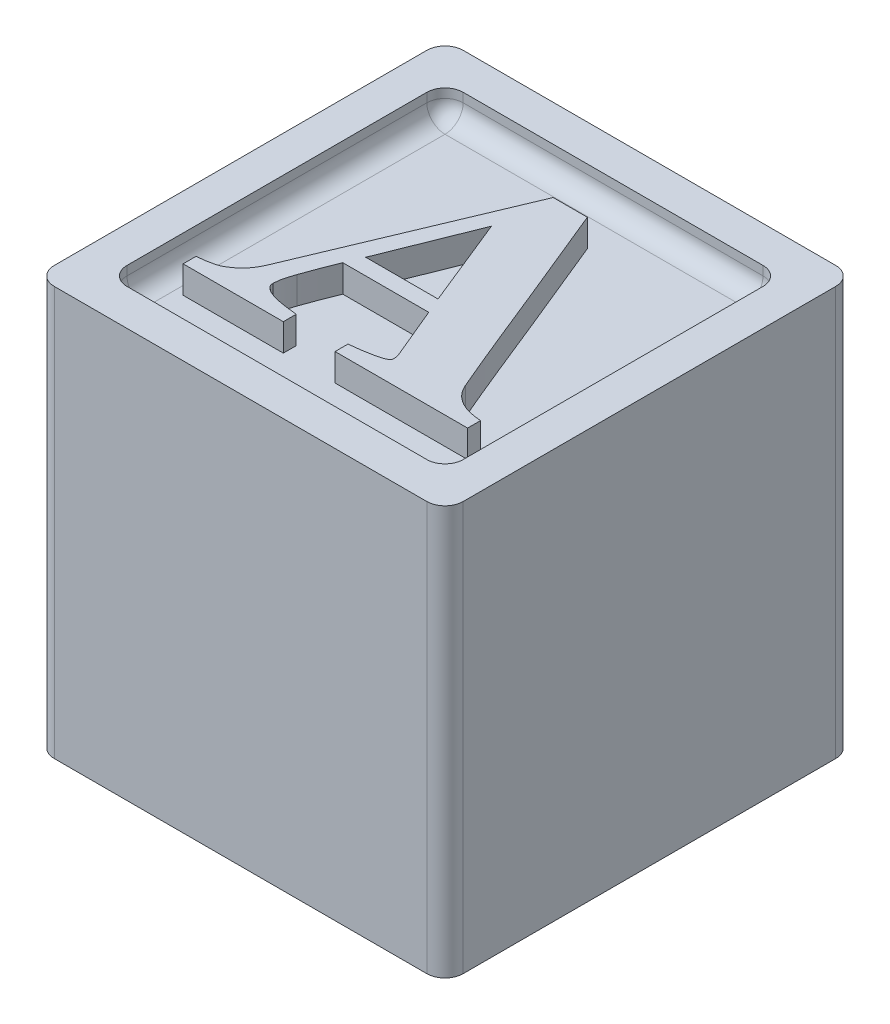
ISO-10303-21;
HEADER;
FILE_DESCRIPTION(('STEP AP214'),'2;1');
FILE_NAME('part.step','',(''),(''),'','','');
FILE_SCHEMA(('AUTOMOTIVE_DESIGN { 1 0 10303 214 1 1 1 1 }'));
ENDSEC;
DATA;
#1=APPLICATION_CONTEXT('core data for automotive mechanical design processes');
#2=APPLICATION_PROTOCOL_DEFINITION('international standard','automotive_design',2000,#1);
#3=PRODUCT_CONTEXT('',#1,'mechanical');
#4=PRODUCT('Part','Part','',(#3));
#5=PRODUCT_RELATED_PRODUCT_CATEGORY('part','',(#4));
#6=PRODUCT_DEFINITION_FORMATION('','',#4);
#7=PRODUCT_DEFINITION_CONTEXT('part definition',#1,'design');
#8=PRODUCT_DEFINITION('design','',#6,#7);
#9=PRODUCT_DEFINITION_SHAPE('','',#8);
#10=(LENGTH_UNIT() NAMED_UNIT(*) SI_UNIT(.MILLI.,.METRE.));
#11=(NAMED_UNIT(*) PLANE_ANGLE_UNIT() SI_UNIT($,.RADIAN.));
#12=(NAMED_UNIT(*) SI_UNIT($,.STERADIAN.) SOLID_ANGLE_UNIT());
#13=UNCERTAINTY_MEASURE_WITH_UNIT(LENGTH_MEASURE(1.E-05),#10,'distance_accuracy_value','');
#14=(GEOMETRIC_REPRESENTATION_CONTEXT(3) GLOBAL_UNCERTAINTY_ASSIGNED_CONTEXT((#13)) GLOBAL_UNIT_ASSIGNED_CONTEXT((#10,
#11,#12)) REPRESENTATION_CONTEXT('',''));
#15=CARTESIAN_POINT('',(0.,0.,0.));
#16=DIRECTION('',(0.,0.,1.));
#17=DIRECTION('',(1.,0.,0.));
#18=AXIS2_PLACEMENT_3D('',#15,#16,#17);
#19=CARTESIAN_POINT('',(39.,42.,-39.));
#20=DIRECTION('',(0.,-1.,0.));
#21=DIRECTION('',(0.,0.,-1.));
#22=AXIS2_PLACEMENT_3D('',#19,#20,#21);
#23=PLANE('',#22);
#24=CARTESIAN_POINT('',(35.7579074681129,42.,-11.2999541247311));
#25=CARTESIAN_POINT('',(35.9463435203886,42.,-11.2067942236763));
#26=CARTESIAN_POINT('',(36.3375683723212,42.,-11.0133786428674));
#27=CARTESIAN_POINT('',(36.9789941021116,42.,-10.8389341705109));
#28=CARTESIAN_POINT('',(37.620953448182,42.,-10.7292782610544));
#29=CARTESIAN_POINT('',(38.0441461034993,42.,-10.6863777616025));
#30=CARTESIAN_POINT('',(38.242693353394,42.,-10.6662503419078));
#31=B_SPLINE_CURVE_WITH_KNOTS('',3,(#24,#25,#26,#27,#28,#29,#30),.UNSPECIFIED.,.F.,.F.,(4,1,1,1,
4),(0.,0.243711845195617,0.505986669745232,0.768226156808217,1.),.UNSPECIFIED.);
#32=CARTESIAN_POINT('',(35.7579074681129,42.,-11.2999541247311));
#33=VERTEX_POINT('',#32);
#34=CARTESIAN_POINT('',(38.242693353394,42.,-10.6662503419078));
#35=VERTEX_POINT('',#34);
#36=EDGE_CURVE('E341',#33,#35,#31,.T.);
#37=ORIENTED_EDGE('',*,*,#36,.T.);
#38=DIRECTION('',(0.,0.,1.));
#39=VECTOR('',#38,1.);
#40=CARTESIAN_POINT('',(38.242693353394,42.,-10.6662503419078));
#41=LINE('',#40,#39);
#42=CARTESIAN_POINT('',(38.242693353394,42.,-9.2431962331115));
#43=VERTEX_POINT('',#42);
#44=EDGE_CURVE('E322',#35,#43,#41,.T.);
#45=ORIENTED_EDGE('',*,*,#44,.T.);
#46=DIRECTION('',(-1.,0.,0.));
#47=VECTOR('',#46,1.);
#48=CARTESIAN_POINT('',(38.242693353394,42.,-9.2431962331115));
#49=LINE('',#48,#47);
#50=CARTESIAN_POINT('',(23.6563887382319,42.,-9.2431962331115));
#51=VERTEX_POINT('',#50);
#52=EDGE_CURVE('E807',#43,#51,#49,.T.);
#53=ORIENTED_EDGE('',*,*,#52,.T.);
#54=DIRECTION('',(0.,0.,-1.));
#55=VECTOR('',#54,1.);
#56=CARTESIAN_POINT('',(23.6563887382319,42.,-9.2431962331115));
#57=LINE('',#56,#55);
#58=CARTESIAN_POINT('',(23.6563887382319,42.,-10.6662503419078));
#59=VERTEX_POINT('',#58);
#60=EDGE_CURVE('E801',#51,#59,#57,.T.);
#61=ORIENTED_EDGE('',*,*,#60,.T.);
#62=CARTESIAN_POINT('',(23.6563887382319,42.,-10.6662503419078));
#63=CARTESIAN_POINT('',(23.8400760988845,42.,-10.6807898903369));
#64=CARTESIAN_POINT('',(24.2252423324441,42.,-10.711277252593));
#65=CARTESIAN_POINT('',(24.8222309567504,42.,-10.8029935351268));
#66=CARTESIAN_POINT('',(25.4693799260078,42.,-10.8956893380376));
#67=CARTESIAN_POINT('',(26.0229408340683,42.,-11.0102482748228));
#68=CARTESIAN_POINT('',(26.4630082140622,42.,-11.0968096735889));
#69=CARTESIAN_POINT('',(26.7518616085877,42.,-11.185019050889));
#70=CARTESIAN_POINT('',(27.0019506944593,42.,-11.2620026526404));
#71=CARTESIAN_POINT('',(27.2026324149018,42.,-11.3535415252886));
#72=CARTESIAN_POINT('',(27.3657535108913,42.,-11.4386991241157));
#73=CARTESIAN_POINT('',(27.476844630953,42.,-11.5394216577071));
#74=CARTESIAN_POINT('',(27.5554825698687,42.,-11.6428419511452));
#75=CARTESIAN_POINT('',(27.5651940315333,42.,-11.719511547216));
#76=CARTESIAN_POINT('',(27.5697875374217,42.,-11.755776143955));
#77=B_SPLINE_CURVE_WITH_KNOTS('',3,(#62,#63,#64,#65,#66,#67,#68,#69,#70,#71,#72,#73,#74,#75,
#76),.UNSPECIFIED.,.F.,.F.,(4,1,1,1,1,1,1,1,1,1,1,1,4),(0.,0.131721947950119,0.276202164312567,
0.431748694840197,0.599105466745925,0.680453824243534,0.752166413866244,0.815019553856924,
0.867220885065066,0.909952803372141,0.945606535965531,0.974271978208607,1.),.UNSPECIFIED.);
#78=CARTESIAN_POINT('',(27.5697875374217,42.,-11.755776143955));
#79=VERTEX_POINT('',#78);
#80=EDGE_CURVE('E793',#59,#79,#77,.T.);
#81=ORIENTED_EDGE('',*,*,#80,.T.);
#82=CARTESIAN_POINT('',(27.5697875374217,42.,-11.755776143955));
#83=CARTESIAN_POINT('',(27.5694351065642,42.,-11.8096507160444));
#84=CARTESIAN_POINT('',(27.5686893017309,42.,-11.9236586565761));
#85=CARTESIAN_POINT('',(27.5338271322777,42.,-12.1106643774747));
#86=CARTESIAN_POINT('',(27.4870765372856,42.,-12.3451044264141));
#87=CARTESIAN_POINT('',(27.4195714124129,42.,-12.5109761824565));
#88=CARTESIAN_POINT('',(27.3807881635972,42.,-12.6062733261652));
#89=B_SPLINE_CURVE_WITH_KNOTS('',3,(#82,#83,#84,#85,#86,#87,#88),.UNSPECIFIED.,.F.,.F.,(4,1,1,1,
4),(0.,0.183923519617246,0.389214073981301,0.649089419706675,1.),.UNSPECIFIED.);
#90=CARTESIAN_POINT('',(27.3807881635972,42.,-12.6062733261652));
#91=VERTEX_POINT('',#90);
#92=EDGE_CURVE('E788',#79,#91,#89,.T.);
#93=ORIENTED_EDGE('',*,*,#92,.T.);
#94=DIRECTION('',(-0.384944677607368,0.,-0.92293964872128));
#95=VECTOR('',#94,1.);
#96=CARTESIAN_POINT('',(27.3807881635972,42.,-12.6062733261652));
#97=LINE('',#96,#95);
#98=CARTESIAN_POINT('',(25.0738840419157,42.,-18.1372844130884));
#99=VERTEX_POINT('',#98);
#100=EDGE_CURVE('E785',#91,#99,#97,.T.);
#101=ORIENTED_EDGE('',*,*,#100,.T.);
#102=DIRECTION('',(-1.,0.,0.));
#103=VECTOR('',#102,1.);
#104=CARTESIAN_POINT('',(25.0738840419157,42.,-18.1372844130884));
#105=LINE('',#104,#103);
#106=CARTESIAN_POINT('',(15.6183565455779,42.,-18.1372844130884));
#107=VERTEX_POINT('',#106);
#108=EDGE_CURVE('E779',#99,#107,#105,.T.);
#109=ORIENTED_EDGE('',*,*,#108,.T.);
#110=CARTESIAN_POINT('',(15.6183565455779,42.,-18.1372844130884));
#111=CARTESIAN_POINT('',(15.5048365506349,42.,-17.8576909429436));
#112=CARTESIAN_POINT('',(15.2610952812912,42.,-17.2573696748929));
#113=CARTESIAN_POINT('',(14.8970058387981,42.,-16.3306961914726));
#114=CARTESIAN_POINT('',(14.5525171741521,42.,-15.3908654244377));
#115=CARTESIAN_POINT('',(14.3320606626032,42.,-14.774334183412));
#116=CARTESIAN_POINT('',(14.2286552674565,42.,-14.4851494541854));
#117=B_SPLINE_CURVE_WITH_KNOTS('',3,(#110,#111,#112,#113,#114,#115,#116),.UNSPECIFIED.,.F.,.F.,
(4,1,1,1,4),(0.,0.231645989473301,0.497372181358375,0.764241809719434,1.),.UNSPECIFIED.);
#118=CARTESIAN_POINT('',(14.2286552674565,42.,-14.4851494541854));
#119=VERTEX_POINT('',#118);
#120=EDGE_CURVE('E771',#107,#119,#117,.T.);
#121=ORIENTED_EDGE('',*,*,#120,.T.);
#122=CARTESIAN_POINT('',(14.2286552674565,42.,-14.4851494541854));
#123=CARTESIAN_POINT('',(14.174323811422,42.,-14.3222829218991));
#124=CARTESIAN_POINT('',(14.0739921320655,42.,-14.0215239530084));
#125=CARTESIAN_POINT('',(13.9444975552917,42.,-13.6055170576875));
#126=CARTESIAN_POINT('',(13.8521247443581,42.,-13.2610791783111));
#127=CARTESIAN_POINT('',(13.7903561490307,42.,-12.9211592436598));
#128=CARTESIAN_POINT('',(13.7575063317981,42.,-12.6106274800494));
#129=CARTESIAN_POINT('',(13.7445275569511,42.,-12.3913641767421));
#130=CARTESIAN_POINT('',(13.7394804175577,42.,-12.306097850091));
#131=B_SPLINE_CURVE_WITH_KNOTS('',3,(#122,#123,#124,#125,#126,#127,#128,#129,#130),
.UNSPECIFIED.,.F.,.F.,(4,1,1,1,1,1,4),(0.,0.229632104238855,0.424052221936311,0.582743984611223,
0.706214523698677,0.88575375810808,1.),.UNSPECIFIED.);
#132=CARTESIAN_POINT('',(13.7394804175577,42.,-12.306097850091));
#133=VERTEX_POINT('',#132);
#134=EDGE_CURVE('E763',#119,#133,#131,.T.);
#135=ORIENTED_EDGE('',*,*,#134,.T.);
#136=CARTESIAN_POINT('',(13.7394804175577,42.,-12.306097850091));
#137=CARTESIAN_POINT('',(13.7522753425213,42.,-12.2070332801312));
#138=CARTESIAN_POINT('',(13.7792916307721,42.,-11.9978599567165));
#139=CARTESIAN_POINT('',(13.9875449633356,42.,-11.7176443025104));
#140=CARTESIAN_POINT('',(14.3029466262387,42.,-11.4708015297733));
#141=CARTESIAN_POINT('',(14.7437584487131,42.,-11.2504682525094));
#142=CARTESIAN_POINT('',(15.3253606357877,42.,-11.057952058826));
#143=CARTESIAN_POINT('',(16.0618343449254,42.,-10.8987012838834));
#144=CARTESIAN_POINT('',(16.9586025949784,42.,-10.7616866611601));
#145=CARTESIAN_POINT('',(17.6116885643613,42.,-10.6997037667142));
#146=CARTESIAN_POINT('',(17.9641723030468,42.,-10.6662503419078));
#147=B_SPLINE_CURVE_WITH_KNOTS('',3,(#136,#137,#138,#139,#140,#141,#142,#143,#144,#145,#146),
.UNSPECIFIED.,.F.,.F.,(4,1,1,1,1,1,1,1,4),(0.,0.0613865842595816,0.129616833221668,
0.210066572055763,0.310281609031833,0.434829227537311,0.591170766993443,0.779346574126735,1.),.UNSPECIFIED.);
#148=CARTESIAN_POINT('',(17.9641723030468,42.,-10.6662503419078));
#149=VERTEX_POINT('',#148);
#150=EDGE_CURVE('E758',#133,#149,#147,.T.);
#151=ORIENTED_EDGE('',*,*,#150,.T.);
#152=DIRECTION('',(0.,0.,1.));
#153=VECTOR('',#152,1.);
#154=CARTESIAN_POINT('',(17.9641723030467,42.,-10.6662503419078));
#155=LINE('',#154,#153);
#156=CARTESIAN_POINT('',(17.9641723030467,42.,-9.2431962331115));
#157=VERTEX_POINT('',#156);
#158=EDGE_CURVE('E755',#149,#157,#155,.T.);
#159=ORIENTED_EDGE('',*,*,#158,.T.);
#160=DIRECTION('',(-1.,0.,0.));
#161=VECTOR('',#160,1.);
#162=CARTESIAN_POINT('',(17.9641723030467,42.,-9.2431962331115));
#163=LINE('',#162,#161);
#164=CARTESIAN_POINT('',(6.93550295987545,42.,-9.2431962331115));
#165=VERTEX_POINT('',#164);
#166=EDGE_CURVE('E752',#157,#165,#163,.T.);
#167=ORIENTED_EDGE('',*,*,#166,.T.);
#168=DIRECTION('',(0.,0.,-1.));
#169=VECTOR('',#168,1.);
#170=CARTESIAN_POINT('',(6.93550295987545,42.,-9.2431962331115));
#171=LINE('',#170,#169);
#172=CARTESIAN_POINT('',(6.93550295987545,42.,-10.6662503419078));
#173=VERTEX_POINT('',#172);
#174=EDGE_CURVE('E746',#165,#173,#171,.T.);
#175=ORIENTED_EDGE('',*,*,#174,.T.);
#176=CARTESIAN_POINT('',(6.93550295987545,42.,-10.6662503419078));
#177=CARTESIAN_POINT('',(7.15645884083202,42.,-10.6850792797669));
#178=CARTESIAN_POINT('',(7.6267662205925,42.,-10.7251569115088));
#179=CARTESIAN_POINT('',(8.21425541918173,42.,-10.8344956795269));
#180=CARTESIAN_POINT('',(8.69491650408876,42.,-10.9345351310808));
#181=CARTESIAN_POINT('',(9.02142840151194,42.,-11.0441890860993));
#182=CARTESIAN_POINT('',(9.31379367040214,42.,-11.1545023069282));
#183=CARTESIAN_POINT('',(9.48433357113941,42.,-11.253318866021));
#184=CARTESIAN_POINT('',(9.56481777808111,42.,-11.2999541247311));
#185=B_SPLINE_CURVE_WITH_KNOTS('',3,(#176,#177,#178,#179,#180,#181,#182,#183,#184),
.UNSPECIFIED.,.F.,.F.,(4,1,1,1,1,1,4),(0.,0.243867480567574,0.519075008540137,0.657078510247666,
0.78346150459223,0.897807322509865,1.),.UNSPECIFIED.);
#186=CARTESIAN_POINT('',(9.56481777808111,42.,-11.2999541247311));
#187=VERTEX_POINT('',#186);
#188=EDGE_CURVE('E738',#173,#187,#185,.T.);
#189=ORIENTED_EDGE('',*,*,#188,.T.);
#190=CARTESIAN_POINT('',(9.56481777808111,42.,-11.2999541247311));
#191=CARTESIAN_POINT('',(9.80880689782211,42.,-11.4561326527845));
#192=CARTESIAN_POINT('',(10.2896176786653,42.,-11.763901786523));
#193=CARTESIAN_POINT('',(10.8947603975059,42.,-12.381212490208));
#194=CARTESIAN_POINT('',(11.40151674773,42.,-13.1038228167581));
#195=CARTESIAN_POINT('',(11.6419678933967,42.,-13.6518830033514));
#196=CARTESIAN_POINT('',(11.7661046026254,42.,-13.9348277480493));
#197=B_SPLINE_CURVE_WITH_KNOTS('',3,(#190,#191,#192,#193,#194,#195,#196),.UNSPECIFIED.,.F.,.F.,
(4,1,1,1,4),(0.,0.247655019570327,0.488034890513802,0.73568991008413,1.),.UNSPECIFIED.);
#198=CARTESIAN_POINT('',(11.7661046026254,42.,-13.9348277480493));
#199=VERTEX_POINT('',#198);
#200=EDGE_CURVE('E730',#187,#199,#197,.T.);
#201=ORIENTED_EDGE('',*,*,#200,.T.);
#202=CARTESIAN_POINT('',(11.7661046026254,42.,-13.9348277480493));
#203=CARTESIAN_POINT('',(12.493847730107,42.,-15.6749265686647));
#204=CARTESIAN_POINT('',(13.9502696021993,42.,-19.1573613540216));
#205=CARTESIAN_POINT('',(15.7879370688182,42.,-23.5318516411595));
#206=CARTESIAN_POINT('',(17.2810939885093,42.,-27.1104748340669));
#207=CARTESIAN_POINT('',(18.4682734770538,42.,-29.9285424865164));
#208=CARTESIAN_POINT('',(19.7046384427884,42.,-32.8834837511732));
#209=CARTESIAN_POINT('',(20.5506158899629,42.,-34.8971882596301));
#210=CARTESIAN_POINT('',(20.9826034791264,42.,-35.9254607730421));
#211=B_SPLINE_CURVE_WITH_KNOTS('',3,(#202,#203,#204,#205,#206,#207,#208,#209,#210),
.UNSPECIFIED.,.F.,.F.,(4,1,1,1,1,1,4),(0.,0.237311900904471,0.474928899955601,0.596983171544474,
0.725189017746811,0.859671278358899,1.),.UNSPECIFIED.);
#212=CARTESIAN_POINT('',(20.9826034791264,42.,-35.9254607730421));
#213=VERTEX_POINT('',#212);
#214=EDGE_CURVE('E725',#199,#213,#211,.T.);
#215=ORIENTED_EDGE('',*,*,#214,.T.);
#216=DIRECTION('',(1.,0.,0.));
#217=VECTOR('',#216,1.);
#218=CARTESIAN_POINT('',(20.9826034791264,42.,-35.9254607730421));
#219=LINE('',#218,#217);
#220=CARTESIAN_POINT('',(24.7403557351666,42.,-35.9254607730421));
#221=VERTEX_POINT('',#220);
#222=EDGE_CURVE('E719',#213,#221,#219,.T.);
#223=ORIENTED_EDGE('',*,*,#222,.T.);
#224=CARTESIAN_POINT('',(24.7403557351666,42.,-35.9254607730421));
#225=CARTESIAN_POINT('',(25.0379518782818,42.,-35.1988112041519));
#226=CARTESIAN_POINT('',(25.6167194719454,42.,-33.7856167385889));
#227=CARTESIAN_POINT('',(26.4730217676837,42.,-31.7290651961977));
#228=CARTESIAN_POINT('',(27.2628845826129,42.,-29.7843557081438));
#229=CARTESIAN_POINT('',(28.0122762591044,42.,-27.9592017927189));
#230=CARTESIAN_POINT('',(28.7016571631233,42.,-26.2478137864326));
#231=CARTESIAN_POINT('',(29.3582829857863,42.,-24.6583334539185));
#232=CARTESIAN_POINT('',(29.9485539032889,42.,-23.1808085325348));
#233=CARTESIAN_POINT('',(30.4999903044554,42.,-21.8119439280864));
#234=CARTESIAN_POINT('',(31.0116575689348,42.,-20.5294169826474));
#235=CARTESIAN_POINT('',(31.5110073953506,42.,-19.3165165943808));
#236=CARTESIAN_POINT('',(31.9801527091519,42.,-18.1544532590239));
#237=CARTESIAN_POINT('',(32.4365077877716,42.,-17.0510746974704));
#238=CARTESIAN_POINT('',(32.8709121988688,42.,-16.0018800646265));
#239=CARTESIAN_POINT('',(33.2866424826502,42.,-15.0108353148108));
#240=CARTESIAN_POINT('',(33.682273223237,42.,-14.0728622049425));
#241=CARTESIAN_POINT('',(33.9417467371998,42.,-13.4677670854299));
#242=CARTESIAN_POINT('',(34.0680307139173,42.,-13.1732714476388));
#243=B_SPLINE_CURVE_WITH_KNOTS('',3,(#224,#225,#226,#227,#228,#229,#230,#231,#232,#233,#234,
#235,#236,#237,#238,#239,#240,#241,#242),.UNSPECIFIED.,.F.,.F.,(4,1,1,1,1,1,1,1,1,1,1,1,1,1,1,1,
4),(0.,0.0957970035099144,0.186306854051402,0.271775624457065,0.351871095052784,
0.427011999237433,0.496864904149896,0.561678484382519,0.621118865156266,0.676907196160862,
0.730136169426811,0.781139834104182,0.829794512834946,0.875805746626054,0.919678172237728,
0.960907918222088,1.),.UNSPECIFIED.);
#244=CARTESIAN_POINT('',(34.0680307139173,42.,-13.1732714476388));
#245=VERTEX_POINT('',#244);
#246=EDGE_CURVE('E711',#221,#245,#243,.T.);
#247=ORIENTED_EDGE('',*,*,#246,.T.);
#248=CARTESIAN_POINT('',(34.0680307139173,42.,-13.1732714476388));
#249=CARTESIAN_POINT('',(34.1564738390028,42.,-12.9949220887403));
#250=CARTESIAN_POINT('',(34.3324537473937,42.,-12.6400510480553));
#251=CARTESIAN_POINT('',(34.6795175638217,42.,-12.137203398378));
#252=CARTESIAN_POINT('',(35.1541163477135,42.,-11.6743459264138));
#253=CARTESIAN_POINT('',(35.5464340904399,42.,-11.4310820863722));
#254=CARTESIAN_POINT('',(35.7579074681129,42.,-11.2999541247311));
#255=B_SPLINE_CURVE_WITH_KNOTS('',3,(#248,#249,#250,#251,#252,#253,#254),.UNSPECIFIED.,.F.,.F.,
(4,1,1,1,4),(0.,0.232302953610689,0.462225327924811,0.710120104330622,1.),.UNSPECIFIED.);
#256=EDGE_CURVE('E704',#245,#33,#255,.T.);
#257=ORIENTED_EDGE('',*,*,#256,.T.);
#258=EDGE_LOOP('',(#37,#45,#53,#61,#81,#93,#101,#109,#121,#135,#151,#159,#167,#175,#189,#201,
#215,#223,#247,#257));
#259=FACE_BOUND('',#258,.T.);
#260=DIRECTION('',(1.,0.,0.));
#261=VECTOR('',#260,1.);
#262=CARTESIAN_POINT('',(39.,42.,-6.00000000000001));
#263=LINE('',#262,#261);
#264=CARTESIAN_POINT('',(6.,42.,-6.00000000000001));
#265=VERTEX_POINT('',#264);
#266=CARTESIAN_POINT('',(39.,42.,-6.00000000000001));
#267=VERTEX_POINT('',#266);
#268=EDGE_CURVE('E499',#265,#267,#263,.T.);
#269=ORIENTED_EDGE('',*,*,#268,.T.);
#270=DIRECTION('',(0.,0.,-1.));
#271=VECTOR('',#270,1.);
#272=CARTESIAN_POINT('',(39.,42.,-39.));
#273=LINE('',#272,#271);
#274=CARTESIAN_POINT('',(39.,42.,-39.));
#275=VERTEX_POINT('',#274);
#276=EDGE_CURVE('E502',#267,#275,#273,.T.);
#277=ORIENTED_EDGE('',*,*,#276,.T.);
#278=DIRECTION('',(-1.,0.,0.));
#279=VECTOR('',#278,1.);
#280=CARTESIAN_POINT('',(6.00000000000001,42.,-39.));
#281=LINE('',#280,#279);
#282=CARTESIAN_POINT('',(6.,42.,-39.));
#283=VERTEX_POINT('',#282);
#284=EDGE_CURVE('E612',#275,#283,#281,.T.);
#285=ORIENTED_EDGE('',*,*,#284,.T.);
#286=DIRECTION('',(0.,0.,1.));
#287=VECTOR('',#286,1.);
#288=CARTESIAN_POINT('',(6.,42.,-6.00000000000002));
#289=LINE('',#288,#287);
#290=EDGE_CURVE('E504',#283,#265,#289,.T.);
#291=ORIENTED_EDGE('',*,*,#290,.T.);
#292=EDGE_LOOP('',(#269,#277,#285,#291));
#293=FACE_BOUND('',#292,.T.);
#294=ADVANCED_FACE('F40',(#259,#293),#23,.F.);
#295=CARTESIAN_POINT('',(0.,45.,0.));
#296=DIRECTION('',(1.,0.,0.));
#297=DIRECTION('',(0.,0.,-1.));
#298=AXIS2_PLACEMENT_3D('',#295,#296,#297);
#299=PLANE('',#298);
#300=DIRECTION('',(0.,0.,1.));
#301=VECTOR('',#300,1.);
#302=CARTESIAN_POINT('',(0.,45.,0.));
#303=LINE('',#302,#301);
#304=CARTESIAN_POINT('',(0.,45.,-43.));
#305=VERTEX_POINT('',#304);
#306=CARTESIAN_POINT('',(0.,45.,-2.));
#307=VERTEX_POINT('',#306);
#308=EDGE_CURVE('E591',#305,#307,#303,.T.);
#309=ORIENTED_EDGE('',*,*,#308,.F.);
#310=DIRECTION('',(0.,-1.,0.));
#311=VECTOR('',#310,1.);
#312=CARTESIAN_POINT('',(0.,45.,-43.));
#313=LINE('',#312,#311);
#314=CARTESIAN_POINT('',(0.,0.,-43.));
#315=VERTEX_POINT('',#314);
#316=EDGE_CURVE('E585',#305,#315,#313,.T.);
#317=ORIENTED_EDGE('',*,*,#316,.T.);
#318=DIRECTION('',(0.,0.,1.));
#319=VECTOR('',#318,1.);
#320=CARTESIAN_POINT('',(0.,0.,0.));
#321=LINE('',#320,#319);
#322=CARTESIAN_POINT('',(0.,0.,-2.));
#323=VERTEX_POINT('',#322);
#324=EDGE_CURVE('E590',#315,#323,#321,.T.);
#325=ORIENTED_EDGE('',*,*,#324,.T.);
#326=DIRECTION('',(0.,-1.,0.));
#327=VECTOR('',#326,1.);
#328=CARTESIAN_POINT('',(0.,45.,-2.));
#329=LINE('',#328,#327);
#330=EDGE_CURVE('E582',#323,#307,#329,.F.);
#331=ORIENTED_EDGE('',*,*,#330,.T.);
#332=EDGE_LOOP('',(#309,#317,#325,#331));
#333=FACE_BOUND('',#332,.T.);
#334=ADVANCED_FACE('F438',(#333),#299,.F.);
#335=CARTESIAN_POINT('',(0.,45.,0.));
#336=DIRECTION('',(0.,0.,-1.));
#337=DIRECTION('',(-1.,0.,0.));
#338=AXIS2_PLACEMENT_3D('',#335,#336,#337);
#339=PLANE('',#338);
#340=DIRECTION('',(1.,0.,0.));
#341=VECTOR('',#340,1.);
#342=CARTESIAN_POINT('',(0.,0.,0.));
#343=LINE('',#342,#341);
#344=CARTESIAN_POINT('',(2.,0.,0.));
#345=VERTEX_POINT('',#344);
#346=CARTESIAN_POINT('',(43.,0.,0.));
#347=VERTEX_POINT('',#346);
#348=EDGE_CURVE('E596',#345,#347,#343,.T.);
#349=ORIENTED_EDGE('',*,*,#348,.T.);
#350=DIRECTION('',(0.,-1.,0.));
#351=VECTOR('',#350,1.);
#352=CARTESIAN_POINT('',(43.,45.,0.));
#353=LINE('',#352,#351);
#354=CARTESIAN_POINT('',(43.,45.,0.));
#355=VERTEX_POINT('',#354);
#356=EDGE_CURVE('E580',#347,#355,#353,.F.);
#357=ORIENTED_EDGE('',*,*,#356,.T.);
#358=DIRECTION('',(1.,0.,0.));
#359=VECTOR('',#358,1.);
#360=CARTESIAN_POINT('',(0.,45.,0.));
#361=LINE('',#360,#359);
#362=CARTESIAN_POINT('',(2.,45.,0.));
#363=VERTEX_POINT('',#362);
#364=EDGE_CURVE('E617',#363,#355,#361,.T.);
#365=ORIENTED_EDGE('',*,*,#364,.F.);
#366=DIRECTION('',(0.,-1.,0.));
#367=VECTOR('',#366,1.);
#368=CARTESIAN_POINT('',(2.,45.,0.));
#369=LINE('',#368,#367);
#370=EDGE_CURVE('E577',#363,#345,#369,.T.);
#371=ORIENTED_EDGE('',*,*,#370,.T.);
#372=EDGE_LOOP('',(#349,#357,#365,#371));
#373=FACE_BOUND('',#372,.T.);
#374=ADVANCED_FACE('F434',(#373),#339,.F.);
#375=CARTESIAN_POINT('',(45.,45.,0.));
#376=DIRECTION('',(-1.,0.,0.));
#377=DIRECTION('',(0.,0.,1.));
#378=AXIS2_PLACEMENT_3D('',#375,#376,#377);
#379=PLANE('',#378);
#380=DIRECTION('',(0.,0.,-1.));
#381=VECTOR('',#380,1.);
#382=CARTESIAN_POINT('',(45.,0.,0.));
#383=LINE('',#382,#381);
#384=CARTESIAN_POINT('',(45.,0.,-2.));
#385=VERTEX_POINT('',#384);
#386=CARTESIAN_POINT('',(45.,0.,-43.));
#387=VERTEX_POINT('',#386);
#388=EDGE_CURVE('E600',#385,#387,#383,.T.);
#389=ORIENTED_EDGE('',*,*,#388,.T.);
#390=DIRECTION('',(0.,-1.,0.));
#391=VECTOR('',#390,1.);
#392=CARTESIAN_POINT('',(45.,45.,-43.));
#393=LINE('',#392,#391);
#394=CARTESIAN_POINT('',(45.,45.,-43.));
#395=VERTEX_POINT('',#394);
#396=EDGE_CURVE('E569',#387,#395,#393,.F.);
#397=ORIENTED_EDGE('',*,*,#396,.T.);
#398=DIRECTION('',(0.,0.,-1.));
#399=VECTOR('',#398,1.);
#400=CARTESIAN_POINT('',(45.,45.,0.));
#401=LINE('',#400,#399);
#402=CARTESIAN_POINT('',(45.,45.,-2.));
#403=VERTEX_POINT('',#402);
#404=EDGE_CURVE('E614',#403,#395,#401,.T.);
#405=ORIENTED_EDGE('',*,*,#404,.F.);
#406=DIRECTION('',(0.,-1.,0.));
#407=VECTOR('',#406,1.);
#408=CARTESIAN_POINT('',(45.,45.,-2.));
#409=LINE('',#408,#407);
#410=EDGE_CURVE('E566',#403,#385,#409,.T.);
#411=ORIENTED_EDGE('',*,*,#410,.T.);
#412=EDGE_LOOP('',(#389,#397,#405,#411));
#413=FACE_BOUND('',#412,.T.);
#414=ADVANCED_FACE('F431',(#413),#379,.F.);
#415=CARTESIAN_POINT('',(0.,45.,-45.));
#416=DIRECTION('',(0.,0.,1.));
#417=DIRECTION('',(1.,0.,0.));
#418=AXIS2_PLACEMENT_3D('',#415,#416,#417);
#419=PLANE('',#418);
#420=DIRECTION('',(-1.,0.,0.));
#421=VECTOR('',#420,1.);
#422=CARTESIAN_POINT('',(0.,0.,-45.));
#423=LINE('',#422,#421);
#424=CARTESIAN_POINT('',(43.,0.,-45.));
#425=VERTEX_POINT('',#424);
#426=CARTESIAN_POINT('',(2.,0.,-45.));
#427=VERTEX_POINT('',#426);
#428=EDGE_CURVE('E610',#425,#427,#423,.T.);
#429=ORIENTED_EDGE('',*,*,#428,.T.);
#430=DIRECTION('',(0.,-1.,0.));
#431=VECTOR('',#430,1.);
#432=CARTESIAN_POINT('',(2.,45.,-45.));
#433=LINE('',#432,#431);
#434=CARTESIAN_POINT('',(2.,45.,-45.));
#435=VERTEX_POINT('',#434);
#436=EDGE_CURVE('E48',#427,#435,#433,.F.);
#437=ORIENTED_EDGE('',*,*,#436,.T.);
#438=DIRECTION('',(-1.,0.,0.));
#439=VECTOR('',#438,1.);
#440=CARTESIAN_POINT('',(0.,45.,-45.));
#441=LINE('',#440,#439);
#442=CARTESIAN_POINT('',(43.,45.,-45.));
#443=VERTEX_POINT('',#442);
#444=EDGE_CURVE('E605',#443,#435,#441,.T.);
#445=ORIENTED_EDGE('',*,*,#444,.F.);
#446=DIRECTION('',(0.,-1.,0.));
#447=VECTOR('',#446,1.);
#448=CARTESIAN_POINT('',(43.,45.,-45.));
#449=LINE('',#448,#447);
#450=EDGE_CURVE('E542',#443,#425,#449,.T.);
#451=ORIENTED_EDGE('',*,*,#450,.T.);
#452=EDGE_LOOP('',(#429,#437,#445,#451));
#453=FACE_BOUND('',#452,.T.);
#454=ADVANCED_FACE('F425',(#453),#419,.F.);
#455=CARTESIAN_POINT('',(0.,45.,0.));
#456=DIRECTION('',(0.,-1.,0.));
#457=DIRECTION('',(0.,0.,-1.));
#458=AXIS2_PLACEMENT_3D('',#455,#456,#457);
#459=PLANE('',#458);
#460=DIRECTION('',(-1.,0.,0.));
#461=VECTOR('',#460,1.);
#462=CARTESIAN_POINT('',(6.00000000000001,45.,-41.));
#463=LINE('',#462,#461);
#464=CARTESIAN_POINT('',(39.,45.,-41.));
#465=VERTEX_POINT('',#464);
#466=CARTESIAN_POINT('',(6.00000000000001,45.,-41.));
#467=VERTEX_POINT('',#466);
#468=EDGE_CURVE('E655',#465,#467,#463,.T.);
#469=ORIENTED_EDGE('',*,*,#468,.F.);
#470=CARTESIAN_POINT('',(39.,45.,-39.));
#471=DIRECTION('',(0.,1.,0.));
#472=DIRECTION('',(0.,0.,-1.));
#473=AXIS2_PLACEMENT_3D('',#470,#471,#472);
#474=CIRCLE('',#473,2.);
#475=CARTESIAN_POINT('',(41.,45.,-39.));
#476=VERTEX_POINT('',#475);
#477=EDGE_CURVE('E556',#476,#465,#474,.T.);
#478=ORIENTED_EDGE('',*,*,#477,.F.);
#479=DIRECTION('',(0.,0.,-1.));
#480=VECTOR('',#479,1.);
#481=CARTESIAN_POINT('',(41.,45.,-39.));
#482=LINE('',#481,#480);
#483=CARTESIAN_POINT('',(41.,45.,-6.00000000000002));
#484=VERTEX_POINT('',#483);
#485=EDGE_CURVE('E627',#484,#476,#482,.T.);
#486=ORIENTED_EDGE('',*,*,#485,.F.);
#487=CARTESIAN_POINT('',(39.,45.,-6.));
#488=DIRECTION('',(0.,1.,0.));
#489=DIRECTION('',(0.,0.,1.));
#490=AXIS2_PLACEMENT_3D('',#487,#488,#489);
#491=CIRCLE('',#490,2.);
#492=CARTESIAN_POINT('',(39.,45.,-4.));
#493=VERTEX_POINT('',#492);
#494=EDGE_CURVE('E640',#493,#484,#491,.T.);
#495=ORIENTED_EDGE('',*,*,#494,.F.);
#496=DIRECTION('',(1.,0.,0.));
#497=VECTOR('',#496,1.);
#498=CARTESIAN_POINT('',(6.00000000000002,45.,-4.));
#499=LINE('',#498,#497);
#500=CARTESIAN_POINT('',(6.00000000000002,45.,-4.00000000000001));
#501=VERTEX_POINT('',#500);
#502=EDGE_CURVE('E643',#501,#493,#499,.T.);
#503=ORIENTED_EDGE('',*,*,#502,.F.);
#504=CARTESIAN_POINT('',(6.,45.,-6.00000000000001));
#505=DIRECTION('',(0.,1.,0.));
#506=DIRECTION('',(0.,0.,1.));
#507=AXIS2_PLACEMENT_3D('',#504,#505,#506);
#508=CIRCLE('',#507,2.);
#509=CARTESIAN_POINT('',(4.,45.,-6.00000000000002));
#510=VERTEX_POINT('',#509);
#511=EDGE_CURVE('E646',#510,#501,#508,.T.);
#512=ORIENTED_EDGE('',*,*,#511,.F.);
#513=DIRECTION('',(0.,0.,1.));
#514=VECTOR('',#513,1.);
#515=CARTESIAN_POINT('',(4.,45.,-39.));
#516=LINE('',#515,#514);
#517=CARTESIAN_POINT('',(4.,45.,-39.));
#518=VERTEX_POINT('',#517);
#519=EDGE_CURVE('E649',#518,#510,#516,.T.);
#520=ORIENTED_EDGE('',*,*,#519,.F.);
#521=CARTESIAN_POINT('',(6.,45.,-39.));
#522=DIRECTION('',(0.,1.,0.));
#523=DIRECTION('',(0.,0.,1.));
#524=AXIS2_PLACEMENT_3D('',#521,#522,#523);
#525=CIRCLE('',#524,2.);
#526=EDGE_CURVE('E652',#467,#518,#525,.T.);
#527=ORIENTED_EDGE('',*,*,#526,.F.);
#528=EDGE_LOOP('',(#469,#478,#486,#495,#503,#512,#520,#527));
#529=FACE_BOUND('',#528,.T.);
#530=ORIENTED_EDGE('',*,*,#444,.T.);
#531=CARTESIAN_POINT('',(2.,45.,-43.));
#532=DIRECTION('',(0.,-1.,0.));
#533=DIRECTION('',(0.,0.,-1.));
#534=AXIS2_PLACEMENT_3D('',#531,#532,#533);
#535=CIRCLE('',#534,2.);
#536=EDGE_CURVE('E11',#435,#305,#535,.F.);
#537=ORIENTED_EDGE('',*,*,#536,.T.);
#538=ORIENTED_EDGE('',*,*,#308,.T.);
#539=CARTESIAN_POINT('',(2.,45.,-2.));
#540=DIRECTION('',(0.,-1.,0.));
#541=DIRECTION('',(0.,0.,-1.));
#542=AXIS2_PLACEMENT_3D('',#539,#540,#541);
#543=CIRCLE('',#542,2.);
#544=EDGE_CURVE('E571',#307,#363,#543,.F.);
#545=ORIENTED_EDGE('',*,*,#544,.T.);
#546=ORIENTED_EDGE('',*,*,#364,.T.);
#547=CARTESIAN_POINT('',(43.,45.,-2.));
#548=DIRECTION('',(0.,-1.,0.));
#549=DIRECTION('',(0.,0.,-1.));
#550=AXIS2_PLACEMENT_3D('',#547,#548,#549);
#551=CIRCLE('',#550,2.);
#552=EDGE_CURVE('E573',#355,#403,#551,.F.);
#553=ORIENTED_EDGE('',*,*,#552,.T.);
#554=ORIENTED_EDGE('',*,*,#404,.T.);
#555=CARTESIAN_POINT('',(43.,45.,-43.));
#556=DIRECTION('',(0.,-1.,0.));
#557=DIRECTION('',(0.,0.,-1.));
#558=AXIS2_PLACEMENT_3D('',#555,#556,#557);
#559=CIRCLE('',#558,2.);
#560=EDGE_CURVE('E575',#395,#443,#559,.F.);
#561=ORIENTED_EDGE('',*,*,#560,.T.);
#562=EDGE_LOOP('',(#530,#537,#538,#545,#546,#553,#554,#561));
#563=FACE_BOUND('',#562,.T.);
#564=ADVANCED_FACE('F422',(#529,#563),#459,.F.);
#565=CARTESIAN_POINT('',(0.,0.,0.));
#566=DIRECTION('',(0.,-1.,0.));
#567=DIRECTION('',(0.,0.,-1.));
#568=AXIS2_PLACEMENT_3D('',#565,#566,#567);
#569=PLANE('',#568);
#570=ORIENTED_EDGE('',*,*,#324,.F.);
#571=CARTESIAN_POINT('',(2.,0.,-43.));
#572=DIRECTION('',(0.,-1.,0.));
#573=DIRECTION('',(0.,0.,-1.));
#574=AXIS2_PLACEMENT_3D('',#571,#572,#573);
#575=CIRCLE('',#574,2.);
#576=EDGE_CURVE('E62',#315,#427,#575,.T.);
#577=ORIENTED_EDGE('',*,*,#576,.T.);
#578=ORIENTED_EDGE('',*,*,#428,.F.);
#579=CARTESIAN_POINT('',(43.,0.,-43.));
#580=DIRECTION('',(0.,-1.,0.));
#581=DIRECTION('',(0.,0.,-1.));
#582=AXIS2_PLACEMENT_3D('',#579,#580,#581);
#583=CIRCLE('',#582,2.);
#584=EDGE_CURVE('E564',#425,#387,#583,.T.);
#585=ORIENTED_EDGE('',*,*,#584,.T.);
#586=ORIENTED_EDGE('',*,*,#388,.F.);
#587=CARTESIAN_POINT('',(43.,0.,-2.));
#588=DIRECTION('',(0.,-1.,0.));
#589=DIRECTION('',(0.,0.,-1.));
#590=AXIS2_PLACEMENT_3D('',#587,#588,#589);
#591=CIRCLE('',#590,2.);
#592=EDGE_CURVE('E562',#385,#347,#591,.T.);
#593=ORIENTED_EDGE('',*,*,#592,.T.);
#594=ORIENTED_EDGE('',*,*,#348,.F.);
#595=CARTESIAN_POINT('',(2.,0.,-2.));
#596=DIRECTION('',(0.,-1.,0.));
#597=DIRECTION('',(0.,0.,-1.));
#598=AXIS2_PLACEMENT_3D('',#595,#596,#597);
#599=CIRCLE('',#598,2.);
#600=EDGE_CURVE('E559',#345,#323,#599,.T.);
#601=ORIENTED_EDGE('',*,*,#600,.T.);
#602=EDGE_LOOP('',(#570,#577,#578,#585,#586,#593,#594,#601));
#603=FACE_BOUND('',#602,.T.);
#604=ADVANCED_FACE('F420',(#603),#569,.T.);
#605=CARTESIAN_POINT('',(39.,42.,-39.));
#606=DIRECTION('',(0.,1.,0.));
#607=DIRECTION('',(0.,0.,1.));
#608=AXIS2_PLACEMENT_3D('',#605,#606,#607);
#609=CYLINDRICAL_SURFACE('',#608,2.);
#610=DIRECTION('',(0.,1.,0.));
#611=VECTOR('',#610,1.);
#612=CARTESIAN_POINT('',(39.,42.,-41.));
#613=LINE('',#612,#611);
#614=CARTESIAN_POINT('',(39.,44.,-41.));
#615=VERTEX_POINT('',#614);
#616=EDGE_CURVE('E624',#615,#465,#613,.T.);
#617=ORIENTED_EDGE('',*,*,#616,.F.);
#618=CARTESIAN_POINT('',(39.,44.,-39.));
#619=DIRECTION('',(0.,1.,0.));
#620=DIRECTION('',(0.,0.,1.));
#621=AXIS2_PLACEMENT_3D('',#618,#619,#620);
#622=CIRCLE('',#621,2.);
#623=CARTESIAN_POINT('',(41.,44.,-39.));
#624=VERTEX_POINT('',#623);
#625=EDGE_CURVE('E540',#615,#624,#622,.F.);
#626=ORIENTED_EDGE('',*,*,#625,.T.);
#627=DIRECTION('',(0.,1.,0.));
#628=VECTOR('',#627,1.);
#629=CARTESIAN_POINT('',(41.,42.,-39.));
#630=LINE('',#629,#628);
#631=EDGE_CURVE('E597',#624,#476,#630,.T.);
#632=ORIENTED_EDGE('',*,*,#631,.T.);
#633=ORIENTED_EDGE('',*,*,#477,.T.);
#634=EDGE_LOOP('',(#617,#626,#632,#633));
#635=FACE_BOUND('',#634,.T.);
#636=ADVANCED_FACE('F392',(#635),#609,.F.);
#637=CARTESIAN_POINT('',(41.,42.,-39.));
#638=DIRECTION('',(1.,0.,0.));
#639=DIRECTION('',(0.,0.,-1.));
#640=AXIS2_PLACEMENT_3D('',#637,#638,#639);
#641=PLANE('',#640);
#642=ORIENTED_EDGE('',*,*,#631,.F.);
#643=DIRECTION('',(0.,0.,-1.));
#644=VECTOR('',#643,1.);
#645=CARTESIAN_POINT('',(41.,44.,-6.00000000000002));
#646=LINE('',#645,#644);
#647=CARTESIAN_POINT('',(41.,44.,-6.00000000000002));
#648=VERTEX_POINT('',#647);
#649=EDGE_CURVE('E525',#624,#648,#646,.F.);
#650=ORIENTED_EDGE('',*,*,#649,.T.);
#651=DIRECTION('',(0.,1.,0.));
#652=VECTOR('',#651,1.);
#653=CARTESIAN_POINT('',(41.,42.,-6.00000000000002));
#654=LINE('',#653,#652);
#655=EDGE_CURVE('E602',#648,#484,#654,.T.);
#656=ORIENTED_EDGE('',*,*,#655,.T.);
#657=ORIENTED_EDGE('',*,*,#485,.T.);
#658=EDGE_LOOP('',(#642,#650,#656,#657));
#659=FACE_BOUND('',#658,.T.);
#660=ADVANCED_FACE('F388',(#659),#641,.F.);
#661=CARTESIAN_POINT('',(39.,42.,-6.));
#662=DIRECTION('',(0.,1.,0.));
#663=DIRECTION('',(0.,0.,1.));
#664=AXIS2_PLACEMENT_3D('',#661,#662,#663);
#665=CYLINDRICAL_SURFACE('',#664,2.);
#666=ORIENTED_EDGE('',*,*,#655,.F.);
#667=CARTESIAN_POINT('',(39.,44.,-6.));
#668=DIRECTION('',(0.,1.,0.));
#669=DIRECTION('',(0.,0.,1.));
#670=AXIS2_PLACEMENT_3D('',#667,#668,#669);
#671=CIRCLE('',#670,2.);
#672=CARTESIAN_POINT('',(39.,44.,-4.));
#673=VERTEX_POINT('',#672);
#674=EDGE_CURVE('E518',#648,#673,#671,.F.);
#675=ORIENTED_EDGE('',*,*,#674,.T.);
#676=DIRECTION('',(0.,1.,0.));
#677=VECTOR('',#676,1.);
#678=CARTESIAN_POINT('',(39.,42.,-4.));
#679=LINE('',#678,#677);
#680=EDGE_CURVE('E635',#673,#493,#679,.T.);
#681=ORIENTED_EDGE('',*,*,#680,.T.);
#682=ORIENTED_EDGE('',*,*,#494,.T.);
#683=EDGE_LOOP('',(#666,#675,#681,#682));
#684=FACE_BOUND('',#683,.T.);
#685=ADVANCED_FACE('F391',(#684),#665,.F.);
#686=CARTESIAN_POINT('',(6.00000000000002,42.,-4.));
#687=DIRECTION('',(0.,0.,1.));
#688=DIRECTION('',(1.,0.,0.));
#689=AXIS2_PLACEMENT_3D('',#686,#687,#688);
#690=PLANE('',#689);
#691=ORIENTED_EDGE('',*,*,#680,.F.);
#692=DIRECTION('',(1.,0.,0.));
#693=VECTOR('',#692,1.);
#694=CARTESIAN_POINT('',(6.00000000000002,44.,-4.));
#695=LINE('',#694,#693);
#696=CARTESIAN_POINT('',(6.00000000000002,44.,-4.00000000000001));
#697=VERTEX_POINT('',#696);
#698=EDGE_CURVE('E512',#673,#697,#695,.F.);
#699=ORIENTED_EDGE('',*,*,#698,.T.);
#700=DIRECTION('',(0.,1.,0.));
#701=VECTOR('',#700,1.);
#702=CARTESIAN_POINT('',(6.00000000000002,42.,-4.00000000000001));
#703=LINE('',#702,#701);
#704=EDGE_CURVE('E633',#697,#501,#703,.T.);
#705=ORIENTED_EDGE('',*,*,#704,.T.);
#706=ORIENTED_EDGE('',*,*,#502,.T.);
#707=EDGE_LOOP('',(#691,#699,#705,#706));
#708=FACE_BOUND('',#707,.T.);
#709=ADVANCED_FACE('F396',(#708),#690,.F.);
#710=CARTESIAN_POINT('',(6.,42.,-6.00000000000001));
#711=DIRECTION('',(0.,1.,0.));
#712=DIRECTION('',(0.,0.,1.));
#713=AXIS2_PLACEMENT_3D('',#710,#711,#712);
#714=CYLINDRICAL_SURFACE('',#713,2.);
#715=ORIENTED_EDGE('',*,*,#704,.F.);
#716=CARTESIAN_POINT('',(6.,44.,-6.00000000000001));
#717=DIRECTION('',(0.,1.,0.));
#718=DIRECTION('',(0.,0.,1.));
#719=AXIS2_PLACEMENT_3D('',#716,#717,#718);
#720=CIRCLE('',#719,2.);
#721=CARTESIAN_POINT('',(4.,44.,-6.00000000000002));
#722=VERTEX_POINT('',#721);
#723=EDGE_CURVE('E532',#697,#722,#720,.F.);
#724=ORIENTED_EDGE('',*,*,#723,.T.);
#725=DIRECTION('',(0.,1.,0.));
#726=VECTOR('',#725,1.);
#727=CARTESIAN_POINT('',(4.,42.,-6.00000000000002));
#728=LINE('',#727,#726);
#729=EDGE_CURVE('E631',#722,#510,#728,.T.);
#730=ORIENTED_EDGE('',*,*,#729,.T.);
#731=ORIENTED_EDGE('',*,*,#511,.T.);
#732=EDGE_LOOP('',(#715,#724,#730,#731));
#733=FACE_BOUND('',#732,.T.);
#734=ADVANCED_FACE('F400',(#733),#714,.F.);
#735=CARTESIAN_POINT('',(4.,42.,-39.));
#736=DIRECTION('',(-1.,0.,0.));
#737=DIRECTION('',(0.,0.,1.));
#738=AXIS2_PLACEMENT_3D('',#735,#736,#737);
#739=PLANE('',#738);
#740=ORIENTED_EDGE('',*,*,#729,.F.);
#741=DIRECTION('',(0.,0.,1.));
#742=VECTOR('',#741,1.);
#743=CARTESIAN_POINT('',(4.,44.,-39.));
#744=LINE('',#743,#742);
#745=CARTESIAN_POINT('',(4.,44.,-39.));
#746=VERTEX_POINT('',#745);
#747=EDGE_CURVE('E534',#722,#746,#744,.F.);
#748=ORIENTED_EDGE('',*,*,#747,.T.);
#749=DIRECTION('',(0.,1.,0.));
#750=VECTOR('',#749,1.);
#751=CARTESIAN_POINT('',(4.,42.,-39.));
#752=LINE('',#751,#750);
#753=EDGE_CURVE('E629',#746,#518,#752,.T.);
#754=ORIENTED_EDGE('',*,*,#753,.T.);
#755=ORIENTED_EDGE('',*,*,#519,.T.);
#756=EDGE_LOOP('',(#740,#748,#754,#755));
#757=FACE_BOUND('',#756,.T.);
#758=ADVANCED_FACE('F404',(#757),#739,.F.);
#759=CARTESIAN_POINT('',(6.,42.,-39.));
#760=DIRECTION('',(0.,1.,0.));
#761=DIRECTION('',(0.,0.,1.));
#762=AXIS2_PLACEMENT_3D('',#759,#760,#761);
#763=CYLINDRICAL_SURFACE('',#762,2.);
#764=ORIENTED_EDGE('',*,*,#753,.F.);
#765=CARTESIAN_POINT('',(6.,44.,-39.));
#766=DIRECTION('',(0.,1.,0.));
#767=DIRECTION('',(0.,0.,1.));
#768=AXIS2_PLACEMENT_3D('',#765,#766,#767);
#769=CIRCLE('',#768,2.);
#770=CARTESIAN_POINT('',(6.00000000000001,44.,-41.));
#771=VERTEX_POINT('',#770);
#772=EDGE_CURVE('E536',#746,#771,#769,.F.);
#773=ORIENTED_EDGE('',*,*,#772,.T.);
#774=DIRECTION('',(0.,1.,0.));
#775=VECTOR('',#774,1.);
#776=CARTESIAN_POINT('',(6.00000000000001,42.,-41.));
#777=LINE('',#776,#775);
#778=EDGE_CURVE('E626',#771,#467,#777,.T.);
#779=ORIENTED_EDGE('',*,*,#778,.T.);
#780=ORIENTED_EDGE('',*,*,#526,.T.);
#781=EDGE_LOOP('',(#764,#773,#779,#780));
#782=FACE_BOUND('',#781,.T.);
#783=ADVANCED_FACE('F408',(#782),#763,.F.);
#784=CARTESIAN_POINT('',(6.00000000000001,42.,-41.));
#785=DIRECTION('',(0.,0.,-1.));
#786=DIRECTION('',(-1.,0.,0.));
#787=AXIS2_PLACEMENT_3D('',#784,#785,#786);
#788=PLANE('',#787);
#789=ORIENTED_EDGE('',*,*,#778,.F.);
#790=DIRECTION('',(-1.,0.,0.));
#791=VECTOR('',#790,1.);
#792=CARTESIAN_POINT('',(39.,44.,-41.));
#793=LINE('',#792,#791);
#794=EDGE_CURVE('E538',#771,#615,#793,.F.);
#795=ORIENTED_EDGE('',*,*,#794,.T.);
#796=ORIENTED_EDGE('',*,*,#616,.T.);
#797=ORIENTED_EDGE('',*,*,#468,.T.);
#798=EDGE_LOOP('',(#789,#795,#796,#797));
#799=FACE_BOUND('',#798,.T.);
#800=ADVANCED_FACE('F412',(#799),#788,.F.);
#801=CARTESIAN_POINT('',(6.,44.,-39.));
#802=DIRECTION('',(0.,0.,-1.));
#803=DIRECTION('',(-1.,0.,0.));
#804=AXIS2_PLACEMENT_3D('',#801,#802,#803);
#805=CYLINDRICAL_SURFACE('',#804,2.);
#806=CARTESIAN_POINT('',(6.,44.,-39.));
#807=DIRECTION('',(0.,0.,1.));
#808=DIRECTION('',(1.,0.,0.));
#809=AXIS2_PLACEMENT_3D('',#806,#807,#808);
#810=CIRCLE('',#809,2.);
#811=EDGE_CURVE('E550',#746,#283,#810,.T.);
#812=ORIENTED_EDGE('',*,*,#811,.F.);
#813=ORIENTED_EDGE('',*,*,#747,.F.);
#814=CARTESIAN_POINT('',(6.,44.,-6.00000000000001));
#815=DIRECTION('',(0.,0.,-1.));
#816=DIRECTION('',(-1.,0.,0.));
#817=AXIS2_PLACEMENT_3D('',#814,#815,#816);
#818=CIRCLE('',#817,2.);
#819=EDGE_CURVE('E553',#265,#722,#818,.T.);
#820=ORIENTED_EDGE('',*,*,#819,.F.);
#821=ORIENTED_EDGE('',*,*,#290,.F.);
#822=EDGE_LOOP('',(#812,#813,#820,#821));
#823=FACE_BOUND('',#822,.T.);
#824=ADVANCED_FACE('F416',(#823),#805,.F.);
#825=CARTESIAN_POINT('',(6.,44.,-6.00000000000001));
#826=DIRECTION('',(0.,0.,1.));
#827=DIRECTION('',(1.,0.,0.));
#828=AXIS2_PLACEMENT_3D('',#825,#826,#827);
#829=SPHERICAL_SURFACE('',#828,2.);
#830=ORIENTED_EDGE('',*,*,#819,.T.);
#831=ORIENTED_EDGE('',*,*,#723,.F.);
#832=CARTESIAN_POINT('',(6.,44.,-6.00000000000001));
#833=DIRECTION('',(-1.,0.,0.));
#834=DIRECTION('',(0.,0.,1.));
#835=AXIS2_PLACEMENT_3D('',#832,#833,#834);
#836=CIRCLE('',#835,2.);
#837=EDGE_CURVE('E548',#265,#697,#836,.T.);
#838=ORIENTED_EDGE('',*,*,#837,.F.);
#839=EDGE_LOOP('',(#830,#831,#838));
#840=FACE_BOUND('',#839,.T.);
#841=ADVANCED_FACE('F466',(#840),#829,.F.);
#842=CARTESIAN_POINT('',(6.,44.,-39.));
#843=DIRECTION('',(0.,0.,1.));
#844=DIRECTION('',(1.,0.,0.));
#845=AXIS2_PLACEMENT_3D('',#842,#843,#844);
#846=SPHERICAL_SURFACE('',#845,2.);
#847=ORIENTED_EDGE('',*,*,#772,.F.);
#848=ORIENTED_EDGE('',*,*,#811,.T.);
#849=CARTESIAN_POINT('',(6.,44.,-39.));
#850=DIRECTION('',(-1.,0.,0.));
#851=DIRECTION('',(0.,0.,1.));
#852=AXIS2_PLACEMENT_3D('',#849,#850,#851);
#853=CIRCLE('',#852,2.);
#854=EDGE_CURVE('E514',#771,#283,#853,.T.);
#855=ORIENTED_EDGE('',*,*,#854,.F.);
#856=EDGE_LOOP('',(#847,#848,#855));
#857=FACE_BOUND('',#856,.T.);
#858=ADVANCED_FACE('F462',(#857),#846,.F.);
#859=CARTESIAN_POINT('',(39.,44.,-6.00000000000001));
#860=DIRECTION('',(-1.,0.,0.));
#861=DIRECTION('',(0.,0.,1.));
#862=AXIS2_PLACEMENT_3D('',#859,#860,#861);
#863=CYLINDRICAL_SURFACE('',#862,2.);
#864=ORIENTED_EDGE('',*,*,#837,.T.);
#865=ORIENTED_EDGE('',*,*,#698,.F.);
#866=CARTESIAN_POINT('',(39.,44.,-6.00000000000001));
#867=DIRECTION('',(-1.,0.,0.));
#868=DIRECTION('',(0.,0.,1.));
#869=AXIS2_PLACEMENT_3D('',#866,#867,#868);
#870=CIRCLE('',#869,2.);
#871=EDGE_CURVE('E510',#267,#673,#870,.T.);
#872=ORIENTED_EDGE('',*,*,#871,.F.);
#873=ORIENTED_EDGE('',*,*,#268,.F.);
#874=EDGE_LOOP('',(#864,#865,#872,#873));
#875=FACE_BOUND('',#874,.T.);
#876=ADVANCED_FACE('F458',(#875),#863,.F.);
#877=CARTESIAN_POINT('',(39.,44.,-39.));
#878=DIRECTION('',(1.,0.,0.));
#879=DIRECTION('',(0.,0.,-1.));
#880=AXIS2_PLACEMENT_3D('',#877,#878,#879);
#881=CYLINDRICAL_SURFACE('',#880,2.);
#882=ORIENTED_EDGE('',*,*,#854,.T.);
#883=ORIENTED_EDGE('',*,*,#284,.F.);
#884=CARTESIAN_POINT('',(39.,44.,-39.));
#885=DIRECTION('',(-1.,0.,0.));
#886=DIRECTION('',(0.,0.,1.));
#887=AXIS2_PLACEMENT_3D('',#884,#885,#886);
#888=CIRCLE('',#887,2.);
#889=EDGE_CURVE('E515',#615,#275,#888,.T.);
#890=ORIENTED_EDGE('',*,*,#889,.F.);
#891=ORIENTED_EDGE('',*,*,#794,.F.);
#892=EDGE_LOOP('',(#882,#883,#890,#891));
#893=FACE_BOUND('',#892,.T.);
#894=ADVANCED_FACE('F454',(#893),#881,.F.);
#895=CARTESIAN_POINT('',(39.,44.,-6.));
#896=DIRECTION('',(0.,0.,1.));
#897=DIRECTION('',(1.,0.,0.));
#898=AXIS2_PLACEMENT_3D('',#895,#896,#897);
#899=SPHERICAL_SURFACE('',#898,2.);
#900=ORIENTED_EDGE('',*,*,#871,.T.);
#901=ORIENTED_EDGE('',*,*,#674,.F.);
#902=CARTESIAN_POINT('',(39.,44.,-6.));
#903=DIRECTION('',(0.,0.,1.));
#904=DIRECTION('',(1.,0.,0.));
#905=AXIS2_PLACEMENT_3D('',#902,#903,#904);
#906=CIRCLE('',#905,2.);
#907=EDGE_CURVE('E517',#267,#648,#906,.T.);
#908=ORIENTED_EDGE('',*,*,#907,.F.);
#909=EDGE_LOOP('',(#900,#901,#908));
#910=FACE_BOUND('',#909,.T.);
#911=ADVANCED_FACE('F450',(#910),#899,.F.);
#912=CARTESIAN_POINT('',(39.,44.,-39.));
#913=DIRECTION('',(0.,0.,1.));
#914=DIRECTION('',(1.,0.,0.));
#915=AXIS2_PLACEMENT_3D('',#912,#913,#914);
#916=SPHERICAL_SURFACE('',#915,2.);
#917=ORIENTED_EDGE('',*,*,#625,.F.);
#918=ORIENTED_EDGE('',*,*,#889,.T.);
#919=CARTESIAN_POINT('',(39.,44.,-39.));
#920=DIRECTION('',(0.,0.,-1.));
#921=DIRECTION('',(-1.,0.,0.));
#922=AXIS2_PLACEMENT_3D('',#919,#920,#921);
#923=CIRCLE('',#922,2.);
#924=EDGE_CURVE('E521',#624,#275,#923,.T.);
#925=ORIENTED_EDGE('',*,*,#924,.F.);
#926=EDGE_LOOP('',(#917,#918,#925));
#927=FACE_BOUND('',#926,.T.);
#928=ADVANCED_FACE('F446',(#927),#916,.F.);
#929=CARTESIAN_POINT('',(39.,44.,-39.));
#930=DIRECTION('',(0.,0.,1.));
#931=DIRECTION('',(1.,0.,0.));
#932=AXIS2_PLACEMENT_3D('',#929,#930,#931);
#933=CYLINDRICAL_SURFACE('',#932,2.);
#934=ORIENTED_EDGE('',*,*,#907,.T.);
#935=ORIENTED_EDGE('',*,*,#649,.F.);
#936=ORIENTED_EDGE('',*,*,#924,.T.);
#937=ORIENTED_EDGE('',*,*,#276,.F.);
#938=EDGE_LOOP('',(#934,#935,#936,#937));
#939=FACE_BOUND('',#938,.T.);
#940=ADVANCED_FACE('F443',(#939),#933,.F.);
#941=CARTESIAN_POINT('',(25.7333427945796,45.,-10.9517977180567));
#942=DIRECTION('',(-1.28530937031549E-13,-1.,-1.14657031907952E-12));
#943=DIRECTION('',(0.,1.14657031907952E-12,-1.));
#944=AXIS2_PLACEMENT_3D('',#941,#942,#943);
#945=PLANE('',#944);
#946=DIRECTION('',(0.,0.,1.));
#947=VECTOR('',#946,1.);
#948=CARTESIAN_POINT('',(38.242693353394,45.,-10.6662503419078));
#949=LINE('',#948,#947);
#950=CARTESIAN_POINT('',(38.242693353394,45.,-10.6662503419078));
#951=VERTEX_POINT('',#950);
#952=CARTESIAN_POINT('',(38.242693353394,45.,-9.2431962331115));
#953=VERTEX_POINT('',#952);
#954=EDGE_CURVE('E337',#951,#953,#949,.T.);
#955=ORIENTED_EDGE('',*,*,#954,.F.);
#956=CARTESIAN_POINT('',(35.7579074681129,45.,-11.2999541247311));
#957=CARTESIAN_POINT('',(35.9463435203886,45.,-11.2067942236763));
#958=CARTESIAN_POINT('',(36.3375683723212,45.,-11.0133786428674));
#959=CARTESIAN_POINT('',(36.9789941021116,45.,-10.8389341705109));
#960=CARTESIAN_POINT('',(37.620953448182,45.,-10.7292782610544));
#961=CARTESIAN_POINT('',(38.0441461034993,45.,-10.6863777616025));
#962=CARTESIAN_POINT('',(38.242693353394,45.,-10.6662503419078));
#963=B_SPLINE_CURVE_WITH_KNOTS('',3,(#956,#957,#958,#959,#960,#961,#962),.UNSPECIFIED.,.F.,.F.,
(4,1,1,1,4),(0.,0.243711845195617,0.505986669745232,0.768226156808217,1.),.UNSPECIFIED.);
#964=CARTESIAN_POINT('',(35.7579074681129,45.,-11.2999541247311));
#965=VERTEX_POINT('',#964);
#966=EDGE_CURVE('E663',#965,#951,#963,.T.);
#967=ORIENTED_EDGE('',*,*,#966,.F.);
#968=CARTESIAN_POINT('',(34.0680307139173,45.,-13.1732714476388));
#969=CARTESIAN_POINT('',(34.1564738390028,45.,-12.9949220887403));
#970=CARTESIAN_POINT('',(34.3324537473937,45.,-12.6400510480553));
#971=CARTESIAN_POINT('',(34.6795175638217,45.,-12.137203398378));
#972=CARTESIAN_POINT('',(35.1541163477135,45.,-11.6743459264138));
#973=CARTESIAN_POINT('',(35.5464340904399,45.,-11.4310820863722));
#974=CARTESIAN_POINT('',(35.7579074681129,45.,-11.2999541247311));
#975=B_SPLINE_CURVE_WITH_KNOTS('',3,(#968,#969,#970,#971,#972,#973,#974),.UNSPECIFIED.,.F.,.F.,
(4,1,1,1,4),(0.,0.232302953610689,0.462225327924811,0.710120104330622,1.),.UNSPECIFIED.);
#976=CARTESIAN_POINT('',(34.0680307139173,45.,-13.1732714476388));
#977=VERTEX_POINT('',#976);
#978=EDGE_CURVE('E816',#977,#965,#975,.T.);
#979=ORIENTED_EDGE('',*,*,#978,.F.);
#980=CARTESIAN_POINT('',(24.7403557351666,45.,-35.9254607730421));
#981=CARTESIAN_POINT('',(25.0379518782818,45.,-35.1988112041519));
#982=CARTESIAN_POINT('',(25.6167194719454,45.,-33.7856167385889));
#983=CARTESIAN_POINT('',(26.4730217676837,45.,-31.7290651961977));
#984=CARTESIAN_POINT('',(27.2628845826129,45.,-29.7843557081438));
#985=CARTESIAN_POINT('',(28.0122762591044,45.,-27.9592017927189));
#986=CARTESIAN_POINT('',(28.7016571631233,45.,-26.2478137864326));
#987=CARTESIAN_POINT('',(29.3582829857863,45.,-24.6583334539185));
#988=CARTESIAN_POINT('',(29.9485539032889,45.,-23.1808085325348));
#989=CARTESIAN_POINT('',(30.4999903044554,45.,-21.8119439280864));
#990=CARTESIAN_POINT('',(31.0116575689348,45.,-20.5294169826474));
#991=CARTESIAN_POINT('',(31.5110073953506,45.,-19.3165165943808));
#992=CARTESIAN_POINT('',(31.9801527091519,45.,-18.1544532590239));
#993=CARTESIAN_POINT('',(32.4365077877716,45.,-17.0510746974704));
#994=CARTESIAN_POINT('',(32.8709121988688,45.,-16.0018800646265));
#995=CARTESIAN_POINT('',(33.2866424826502,45.,-15.0108353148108));
#996=CARTESIAN_POINT('',(33.682273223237,45.,-14.0728622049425));
#997=CARTESIAN_POINT('',(33.9417467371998,45.,-13.4677670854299));
#998=CARTESIAN_POINT('',(34.0680307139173,45.,-13.1732714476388));
#999=B_SPLINE_CURVE_WITH_KNOTS('',3,(#980,#981,#982,#983,#984,#985,#986,#987,#988,#989,#990,
#991,#992,#993,#994,#995,#996,#997,#998),.UNSPECIFIED.,.F.,.F.,(4,1,1,1,1,1,1,1,1,1,1,1,1,1,1,1,
4),(0.,0.0957970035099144,0.186306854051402,0.271775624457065,0.351871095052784,
0.427011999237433,0.496864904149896,0.561678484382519,0.621118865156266,0.676907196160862,
0.730136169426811,0.781139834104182,0.829794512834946,0.875805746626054,0.919678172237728,
0.960907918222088,1.),.UNSPECIFIED.);
#1000=CARTESIAN_POINT('',(24.7403557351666,45.,-35.9254607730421));
#1001=VERTEX_POINT('',#1000);
#1002=EDGE_CURVE('E840',#1001,#977,#999,.T.);
#1003=ORIENTED_EDGE('',*,*,#1002,.F.);
#1004=DIRECTION('',(1.,0.,0.));
#1005=VECTOR('',#1004,1.);
#1006=CARTESIAN_POINT('',(20.9826034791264,45.,-35.9254607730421));
#1007=LINE('',#1006,#1005);
#1008=CARTESIAN_POINT('',(20.9826034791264,45.,-35.9254607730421));
#1009=VERTEX_POINT('',#1008);
#1010=EDGE_CURVE('E846',#1009,#1001,#1007,.T.);
#1011=ORIENTED_EDGE('',*,*,#1010,.F.);
#1012=CARTESIAN_POINT('',(11.7661046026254,45.,-13.9348277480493));
#1013=CARTESIAN_POINT('',(12.493847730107,45.,-15.6749265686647));
#1014=CARTESIAN_POINT('',(13.9502696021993,45.,-19.1573613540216));
#1015=CARTESIAN_POINT('',(15.7879370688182,45.,-23.5318516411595));
#1016=CARTESIAN_POINT('',(17.2810939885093,45.,-27.1104748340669));
#1017=CARTESIAN_POINT('',(18.4682734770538,45.,-29.9285424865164));
#1018=CARTESIAN_POINT('',(19.7046384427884,45.,-32.8834837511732));
#1019=CARTESIAN_POINT('',(20.5506158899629,45.,-34.8971882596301));
#1020=CARTESIAN_POINT('',(20.9826034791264,45.,-35.9254607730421));
#1021=B_SPLINE_CURVE_WITH_KNOTS('',3,(#1012,#1013,#1014,#1015,#1016,#1017,#1018,#1019,#1020),
.UNSPECIFIED.,.F.,.F.,(4,1,1,1,1,1,4),(0.,0.237311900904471,0.474928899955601,0.596983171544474,
0.725189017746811,0.859671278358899,1.),.UNSPECIFIED.);
#1022=CARTESIAN_POINT('',(11.7661046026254,45.,-13.9348277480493));
#1023=VERTEX_POINT('',#1022);
#1024=EDGE_CURVE('E852',#1023,#1009,#1021,.T.);
#1025=ORIENTED_EDGE('',*,*,#1024,.F.);
#1026=CARTESIAN_POINT('',(9.56481777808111,45.,-11.2999541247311));
#1027=CARTESIAN_POINT('',(9.80880689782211,45.,-11.4561326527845));
#1028=CARTESIAN_POINT('',(10.2896176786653,45.,-11.763901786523));
#1029=CARTESIAN_POINT('',(10.8947603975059,45.,-12.381212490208));
#1030=CARTESIAN_POINT('',(11.40151674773,45.,-13.1038228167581));
#1031=CARTESIAN_POINT('',(11.6419678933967,45.,-13.6518830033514));
#1032=CARTESIAN_POINT('',(11.7661046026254,45.,-13.9348277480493));
#1033=B_SPLINE_CURVE_WITH_KNOTS('',3,(#1026,#1027,#1028,#1029,#1030,#1031,#1032),.UNSPECIFIED.,
.F.,.F.,(4,1,1,1,4),(0.,0.247655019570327,0.488034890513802,0.73568991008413,1.),.UNSPECIFIED.);
#1034=CARTESIAN_POINT('',(9.56481777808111,45.,-11.2999541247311));
#1035=VERTEX_POINT('',#1034);
#1036=EDGE_CURVE('E858',#1035,#1023,#1033,.T.);
#1037=ORIENTED_EDGE('',*,*,#1036,.F.);
#1038=CARTESIAN_POINT('',(6.93550295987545,45.,-10.6662503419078));
#1039=CARTESIAN_POINT('',(7.15645884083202,45.,-10.6850792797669));
#1040=CARTESIAN_POINT('',(7.6267662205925,45.,-10.7251569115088));
#1041=CARTESIAN_POINT('',(8.21425541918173,45.,-10.8344956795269));
#1042=CARTESIAN_POINT('',(8.69491650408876,45.,-10.9345351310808));
#1043=CARTESIAN_POINT('',(9.02142840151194,45.,-11.0441890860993));
#1044=CARTESIAN_POINT('',(9.31379367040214,45.,-11.1545023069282));
#1045=CARTESIAN_POINT('',(9.48433357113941,45.,-11.253318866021));
#1046=CARTESIAN_POINT('',(9.56481777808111,45.,-11.2999541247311));
#1047=B_SPLINE_CURVE_WITH_KNOTS('',3,(#1038,#1039,#1040,#1041,#1042,#1043,#1044,#1045,#1046),
.UNSPECIFIED.,.F.,.F.,(4,1,1,1,1,1,4),(0.,0.243867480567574,0.519075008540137,0.657078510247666,
0.78346150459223,0.897807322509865,1.),.UNSPECIFIED.);
#1048=CARTESIAN_POINT('',(6.93550295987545,45.,-10.6662503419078));
#1049=VERTEX_POINT('',#1048);
#1050=EDGE_CURVE('E880',#1049,#1035,#1047,.T.);
#1051=ORIENTED_EDGE('',*,*,#1050,.F.);
#1052=DIRECTION('',(0.,0.,-1.));
#1053=VECTOR('',#1052,1.);
#1054=CARTESIAN_POINT('',(6.93550295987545,45.,-9.2431962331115));
#1055=LINE('',#1054,#1053);
#1056=CARTESIAN_POINT('',(6.93550295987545,45.,-9.2431962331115));
#1057=VERTEX_POINT('',#1056);
#1058=EDGE_CURVE('E886',#1057,#1049,#1055,.T.);
#1059=ORIENTED_EDGE('',*,*,#1058,.F.);
#1060=DIRECTION('',(-1.,0.,0.));
#1061=VECTOR('',#1060,1.);
#1062=CARTESIAN_POINT('',(17.9641723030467,45.,-9.2431962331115));
#1063=LINE('',#1062,#1061);
#1064=CARTESIAN_POINT('',(17.9641723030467,45.,-9.2431962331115));
#1065=VERTEX_POINT('',#1064);
#1066=EDGE_CURVE('E892',#1065,#1057,#1063,.T.);
#1067=ORIENTED_EDGE('',*,*,#1066,.F.);
#1068=DIRECTION('',(0.,0.,1.));
#1069=VECTOR('',#1068,1.);
#1070=CARTESIAN_POINT('',(17.9641723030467,45.,-10.6662503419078));
#1071=LINE('',#1070,#1069);
#1072=CARTESIAN_POINT('',(17.9641723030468,45.,-10.6662503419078));
#1073=VERTEX_POINT('',#1072);
#1074=EDGE_CURVE('E895',#1073,#1065,#1071,.T.);
#1075=ORIENTED_EDGE('',*,*,#1074,.F.);
#1076=CARTESIAN_POINT('',(13.7394804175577,45.,-12.306097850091));
#1077=CARTESIAN_POINT('',(13.7522753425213,45.,-12.2070332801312));
#1078=CARTESIAN_POINT('',(13.7792916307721,45.,-11.9978599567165));
#1079=CARTESIAN_POINT('',(13.9875449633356,45.,-11.7176443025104));
#1080=CARTESIAN_POINT('',(14.3029466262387,45.,-11.4708015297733));
#1081=CARTESIAN_POINT('',(14.7437584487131,45.,-11.2504682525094));
#1082=CARTESIAN_POINT('',(15.3253606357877,45.,-11.057952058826));
#1083=CARTESIAN_POINT('',(16.0618343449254,45.,-10.8987012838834));
#1084=CARTESIAN_POINT('',(16.9586025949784,45.,-10.7616866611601));
#1085=CARTESIAN_POINT('',(17.6116885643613,45.,-10.6997037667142));
#1086=CARTESIAN_POINT('',(17.9641723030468,45.,-10.6662503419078));
#1087=B_SPLINE_CURVE_WITH_KNOTS('',3,(#1076,#1077,#1078,#1079,#1080,#1081,#1082,#1083,#1084,
#1085,#1086),.UNSPECIFIED.,.F.,.F.,(4,1,1,1,1,1,1,1,4),(0.,0.0613865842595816,0.129616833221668,
0.210066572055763,0.310281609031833,0.434829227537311,0.591170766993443,0.779346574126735,1.),.UNSPECIFIED.);
#1088=CARTESIAN_POINT('',(13.7394804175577,45.,-12.306097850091));
#1089=VERTEX_POINT('',#1088);
#1090=EDGE_CURVE('E898',#1089,#1073,#1087,.T.);
#1091=ORIENTED_EDGE('',*,*,#1090,.F.);
#1092=CARTESIAN_POINT('',(14.2286552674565,45.,-14.4851494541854));
#1093=CARTESIAN_POINT('',(14.174323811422,45.,-14.3222829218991));
#1094=CARTESIAN_POINT('',(14.0739921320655,45.,-14.0215239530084));
#1095=CARTESIAN_POINT('',(13.9444975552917,45.,-13.6055170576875));
#1096=CARTESIAN_POINT('',(13.8521247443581,45.,-13.2610791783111));
#1097=CARTESIAN_POINT('',(13.7903561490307,45.,-12.9211592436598));
#1098=CARTESIAN_POINT('',(13.7575063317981,45.,-12.6106274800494));
#1099=CARTESIAN_POINT('',(13.7445275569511,45.,-12.3913641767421));
#1100=CARTESIAN_POINT('',(13.7394804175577,45.,-12.306097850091));
#1101=B_SPLINE_CURVE_WITH_KNOTS('',3,(#1092,#1093,#1094,#1095,#1096,#1097,#1098,#1099,#1100),
.UNSPECIFIED.,.F.,.F.,(4,1,1,1,1,1,4),(0.,0.229632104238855,0.424052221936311,0.582743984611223,
0.706214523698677,0.88575375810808,1.),.UNSPECIFIED.);
#1102=CARTESIAN_POINT('',(14.2286552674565,45.,-14.4851494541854));
#1103=VERTEX_POINT('',#1102);
#1104=EDGE_CURVE('E904',#1103,#1089,#1101,.T.);
#1105=ORIENTED_EDGE('',*,*,#1104,.F.);
#1106=CARTESIAN_POINT('',(15.6183565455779,45.,-18.1372844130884));
#1107=CARTESIAN_POINT('',(15.5048365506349,45.,-17.8576909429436));
#1108=CARTESIAN_POINT('',(15.2610952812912,45.,-17.2573696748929));
#1109=CARTESIAN_POINT('',(14.8970058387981,45.,-16.3306961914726));
#1110=CARTESIAN_POINT('',(14.5525171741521,45.,-15.3908654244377));
#1111=CARTESIAN_POINT('',(14.3320606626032,45.,-14.774334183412));
#1112=CARTESIAN_POINT('',(14.2286552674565,45.,-14.4851494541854));
#1113=B_SPLINE_CURVE_WITH_KNOTS('',3,(#1106,#1107,#1108,#1109,#1110,#1111,#1112),.UNSPECIFIED.,
.F.,.F.,(4,1,1,1,4),(0.,0.231645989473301,0.497372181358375,0.764241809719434,1.),.UNSPECIFIED.);
#1114=CARTESIAN_POINT('',(15.6183565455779,45.,-18.1372844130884));
#1115=VERTEX_POINT('',#1114);
#1116=EDGE_CURVE('E928',#1115,#1103,#1113,.T.);
#1117=ORIENTED_EDGE('',*,*,#1116,.F.);
#1118=DIRECTION('',(-1.,0.,0.));
#1119=VECTOR('',#1118,1.);
#1120=CARTESIAN_POINT('',(25.0738840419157,45.,-18.1372844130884));
#1121=LINE('',#1120,#1119);
#1122=CARTESIAN_POINT('',(25.0738840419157,45.,-18.1372844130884));
#1123=VERTEX_POINT('',#1122);
#1124=EDGE_CURVE('E934',#1123,#1115,#1121,.T.);
#1125=ORIENTED_EDGE('',*,*,#1124,.F.);
#1126=DIRECTION('',(-0.384944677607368,0.,-0.92293964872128));
#1127=VECTOR('',#1126,1.);
#1128=CARTESIAN_POINT('',(27.3807881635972,45.,-12.6062733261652));
#1129=LINE('',#1128,#1127);
#1130=CARTESIAN_POINT('',(27.3807881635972,45.,-12.6062733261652));
#1131=VERTEX_POINT('',#1130);
#1132=EDGE_CURVE('E939',#1131,#1123,#1129,.T.);
#1133=ORIENTED_EDGE('',*,*,#1132,.F.);
#1134=CARTESIAN_POINT('',(27.5697875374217,45.,-11.755776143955));
#1135=CARTESIAN_POINT('',(27.5694351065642,45.,-11.8096507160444));
#1136=CARTESIAN_POINT('',(27.5686893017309,45.,-11.9236586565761));
#1137=CARTESIAN_POINT('',(27.5338271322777,45.,-12.1106643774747));
#1138=CARTESIAN_POINT('',(27.4870765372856,45.,-12.3451044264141));
#1139=CARTESIAN_POINT('',(27.4195714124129,45.,-12.5109761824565));
#1140=CARTESIAN_POINT('',(27.3807881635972,45.,-12.6062733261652));
#1141=B_SPLINE_CURVE_WITH_KNOTS('',3,(#1134,#1135,#1136,#1137,#1138,#1139,#1140),.UNSPECIFIED.,
.F.,.F.,(4,1,1,1,4),(0.,0.183923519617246,0.389214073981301,0.649089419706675,1.),.UNSPECIFIED.);
#1142=CARTESIAN_POINT('',(27.5697875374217,45.,-11.755776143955));
#1143=VERTEX_POINT('',#1142);
#1144=EDGE_CURVE('E353',#1143,#1131,#1141,.T.);
#1145=ORIENTED_EDGE('',*,*,#1144,.F.);
#1146=CARTESIAN_POINT('',(23.6563887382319,45.,-10.6662503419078));
#1147=CARTESIAN_POINT('',(23.8400760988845,45.,-10.6807898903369));
#1148=CARTESIAN_POINT('',(24.2252423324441,45.,-10.711277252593));
#1149=CARTESIAN_POINT('',(24.8222309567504,45.,-10.8029935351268));
#1150=CARTESIAN_POINT('',(25.4693799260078,45.,-10.8956893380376));
#1151=CARTESIAN_POINT('',(26.0229408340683,45.,-11.0102482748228));
#1152=CARTESIAN_POINT('',(26.4630082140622,45.,-11.0968096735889));
#1153=CARTESIAN_POINT('',(26.7518616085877,45.,-11.185019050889));
#1154=CARTESIAN_POINT('',(27.0019506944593,45.,-11.2620026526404));
#1155=CARTESIAN_POINT('',(27.2026324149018,45.,-11.3535415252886));
#1156=CARTESIAN_POINT('',(27.3657535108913,45.,-11.4386991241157));
#1157=CARTESIAN_POINT('',(27.476844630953,45.,-11.5394216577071));
#1158=CARTESIAN_POINT('',(27.5554825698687,45.,-11.6428419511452));
#1159=CARTESIAN_POINT('',(27.5651940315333,45.,-11.719511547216));
#1160=CARTESIAN_POINT('',(27.5697875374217,45.,-11.755776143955));
#1161=B_SPLINE_CURVE_WITH_KNOTS('',3,(#1146,#1147,#1148,#1149,#1150,#1151,#1152,#1153,#1154,
#1155,#1156,#1157,#1158,#1159,#1160),.UNSPECIFIED.,.F.,.F.,(4,1,1,1,1,1,1,1,1,1,1,1,4),(0.,
0.131721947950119,0.276202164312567,0.431748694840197,0.599105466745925,0.680453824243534,
0.752166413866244,0.815019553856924,0.867220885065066,0.909952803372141,0.945606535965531,
0.974271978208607,1.),.UNSPECIFIED.);
#1162=CARTESIAN_POINT('',(23.6563887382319,45.,-10.6662503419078));
#1163=VERTEX_POINT('',#1162);
#1164=EDGE_CURVE('E347',#1163,#1143,#1161,.T.);
#1165=ORIENTED_EDGE('',*,*,#1164,.F.);
#1166=DIRECTION('',(0.,0.,-1.));
#1167=VECTOR('',#1166,1.);
#1168=CARTESIAN_POINT('',(23.6563887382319,45.,-9.2431962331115));
#1169=LINE('',#1168,#1167);
#1170=CARTESIAN_POINT('',(23.6563887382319,45.,-9.2431962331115));
#1171=VERTEX_POINT('',#1170);
#1172=EDGE_CURVE('E344',#1171,#1163,#1169,.T.);
#1173=ORIENTED_EDGE('',*,*,#1172,.F.);
#1174=DIRECTION('',(-1.,0.,0.));
#1175=VECTOR('',#1174,1.);
#1176=CARTESIAN_POINT('',(38.242693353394,45.,-9.2431962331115));
#1177=LINE('',#1176,#1175);
#1178=EDGE_CURVE('E340',#953,#1171,#1177,.T.);
#1179=ORIENTED_EDGE('',*,*,#1178,.F.);
#1180=EDGE_LOOP('',(#955,#967,#979,#1003,#1011,#1025,#1037,#1051,#1059,#1067,#1075,#1091,#1105,
#1117,#1125,#1133,#1145,#1165,#1173,#1179));
#1181=FACE_BOUND('',#1180,.T.);
#1182=DIRECTION('',(1.,0.,0.));
#1183=VECTOR('',#1182,1.);
#1184=CARTESIAN_POINT('',(16.3576776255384,45.,-19.9161020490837));
#1185=LINE('',#1184,#1183);
#1186=CARTESIAN_POINT('',(16.3576776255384,45.,-19.9161020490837));
#1187=VERTEX_POINT('',#1186);
#1188=CARTESIAN_POINT('',(24.3178865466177,45.,-19.9161020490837));
#1189=VERTEX_POINT('',#1188);
#1190=EDGE_CURVE('E304',#1187,#1189,#1185,.T.);
#1191=ORIENTED_EDGE('',*,*,#1190,.F.);
#1192=DIRECTION('',(-0.371750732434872,0.,0.928332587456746));
#1193=VECTOR('',#1192,1.);
#1194=CARTESIAN_POINT('',(20.3155468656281,45.,-29.799657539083));
#1195=LINE('',#1194,#1193);
#1196=CARTESIAN_POINT('',(20.3155468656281,45.0000000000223,-29.799657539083));
#1197=VERTEX_POINT('',#1196);
#1198=EDGE_CURVE('E326',#1197,#1187,#1195,.T.);
#1199=ORIENTED_EDGE('',*,*,#1198,.F.);
#1200=DIRECTION('',(-0.375342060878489,0.,-0.926886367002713));
#1201=VECTOR('',#1200,1.);
#1202=CARTESIAN_POINT('',(24.3178865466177,45.,-19.9161020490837));
#1203=LINE('',#1202,#1201);
#1204=EDGE_CURVE('E314',#1189,#1197,#1203,.T.);
#1205=ORIENTED_EDGE('',*,*,#1204,.F.);
#1206=EDGE_LOOP('',(#1191,#1199,#1205));
#1207=FACE_BOUND('',#1206,.T.);
#1208=ADVANCED_FACE('F325',(#1181,#1207),#945,.F.);
#1209=CARTESIAN_POINT('',(38.242693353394,45.,-10.6662503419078));
#1210=DIRECTION('',(1.,0.,0.));
#1211=DIRECTION('',(0.,0.,-1.));
#1212=AXIS2_PLACEMENT_3D('',#1209,#1210,#1211);
#1213=PLANE('',#1212);
#1214=ORIENTED_EDGE('',*,*,#44,.F.);
#1215=DIRECTION('',(0.,-1.,0.));
#1216=VECTOR('',#1215,1.);
#1217=CARTESIAN_POINT('',(38.242693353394,45.,-10.6662503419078));
#1218=LINE('',#1217,#1216);
#1219=EDGE_CURVE('E543',#951,#35,#1218,.T.);
#1220=ORIENTED_EDGE('',*,*,#1219,.F.);
#1221=ORIENTED_EDGE('',*,*,#954,.T.);
#1222=DIRECTION('',(0.,-1.,0.));
#1223=VECTOR('',#1222,1.);
#1224=CARTESIAN_POINT('',(38.242693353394,45.,-9.2431962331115));
#1225=LINE('',#1224,#1223);
#1226=EDGE_CURVE('E660',#953,#43,#1225,.T.);
#1227=ORIENTED_EDGE('',*,*,#1226,.T.);
#1228=EDGE_LOOP('',(#1214,#1220,#1221,#1227));
#1229=FACE_BOUND('',#1228,.T.);
#1230=ADVANCED_FACE('F377',(#1229),#1213,.T.);
#1231=DIRECTION('',(0.,-1.,0.));
#1232=VECTOR('',#1231,1.);
#1233=SURFACE_OF_LINEAR_EXTRUSION('',#963,#1232);
#1234=ORIENTED_EDGE('',*,*,#36,.F.);
#1235=DIRECTION('',(0.,-1.,0.));
#1236=VECTOR('',#1235,1.);
#1237=CARTESIAN_POINT('',(35.7579074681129,45.,-11.2999541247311));
#1238=LINE('',#1237,#1236);
#1239=EDGE_CURVE('E698',#965,#33,#1238,.T.);
#1240=ORIENTED_EDGE('',*,*,#1239,.F.);
#1241=ORIENTED_EDGE('',*,*,#966,.T.);
#1242=ORIENTED_EDGE('',*,*,#1219,.T.);
#1243=EDGE_LOOP('',(#1234,#1240,#1241,#1242));
#1244=FACE_BOUND('',#1243,.T.);
#1245=ADVANCED_FACE('F380',(#1244),#1233,.T.);
#1246=DIRECTION('',(0.,-1.,0.));
#1247=VECTOR('',#1246,1.);
#1248=SURFACE_OF_LINEAR_EXTRUSION('',#975,#1247);
#1249=ORIENTED_EDGE('',*,*,#256,.F.);
#1250=DIRECTION('',(0.,-1.,0.));
#1251=VECTOR('',#1250,1.);
#1252=CARTESIAN_POINT('',(34.0680307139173,45.,-13.1732714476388));
#1253=LINE('',#1252,#1251);
#1254=EDGE_CURVE('E696',#977,#245,#1253,.T.);
#1255=ORIENTED_EDGE('',*,*,#1254,.F.);
#1256=ORIENTED_EDGE('',*,*,#978,.T.);
#1257=ORIENTED_EDGE('',*,*,#1239,.T.);
#1258=EDGE_LOOP('',(#1249,#1255,#1256,#1257));
#1259=FACE_BOUND('',#1258,.T.);
#1260=ADVANCED_FACE('F828',(#1259),#1248,.T.);
#1261=DIRECTION('',(0.,-1.,0.));
#1262=VECTOR('',#1261,1.);
#1263=SURFACE_OF_LINEAR_EXTRUSION('',#999,#1262);
#1264=ORIENTED_EDGE('',*,*,#246,.F.);
#1265=DIRECTION('',(0.,-1.,0.));
#1266=VECTOR('',#1265,1.);
#1267=CARTESIAN_POINT('',(24.7403557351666,45.,-35.9254607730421));
#1268=LINE('',#1267,#1266);
#1269=EDGE_CURVE('E694',#1001,#221,#1268,.T.);
#1270=ORIENTED_EDGE('',*,*,#1269,.F.);
#1271=ORIENTED_EDGE('',*,*,#1002,.T.);
#1272=ORIENTED_EDGE('',*,*,#1254,.T.);
#1273=EDGE_LOOP('',(#1264,#1270,#1271,#1272));
#1274=FACE_BOUND('',#1273,.T.);
#1275=ADVANCED_FACE('F833',(#1274),#1263,.T.);
#1276=CARTESIAN_POINT('',(20.9826034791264,45.,-35.9254607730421));
#1277=DIRECTION('',(0.,0.,-1.));
#1278=DIRECTION('',(-1.,0.,0.));
#1279=AXIS2_PLACEMENT_3D('',#1276,#1277,#1278);
#1280=PLANE('',#1279);
#1281=ORIENTED_EDGE('',*,*,#222,.F.);
#1282=DIRECTION('',(0.,-1.,0.));
#1283=VECTOR('',#1282,1.);
#1284=CARTESIAN_POINT('',(20.9826034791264,45.,-35.9254607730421));
#1285=LINE('',#1284,#1283);
#1286=EDGE_CURVE('E692',#1009,#213,#1285,.T.);
#1287=ORIENTED_EDGE('',*,*,#1286,.F.);
#1288=ORIENTED_EDGE('',*,*,#1010,.T.);
#1289=ORIENTED_EDGE('',*,*,#1269,.T.);
#1290=EDGE_LOOP('',(#1281,#1287,#1288,#1289));
#1291=FACE_BOUND('',#1290,.T.);
#1292=ADVANCED_FACE('F837',(#1291),#1280,.T.);
#1293=DIRECTION('',(0.,-1.,0.));
#1294=VECTOR('',#1293,1.);
#1295=SURFACE_OF_LINEAR_EXTRUSION('',#1021,#1294);
#1296=ORIENTED_EDGE('',*,*,#214,.F.);
#1297=DIRECTION('',(0.,-1.,0.));
#1298=VECTOR('',#1297,1.);
#1299=CARTESIAN_POINT('',(11.7661046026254,45.,-13.9348277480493));
#1300=LINE('',#1299,#1298);
#1301=EDGE_CURVE('E690',#1023,#199,#1300,.T.);
#1302=ORIENTED_EDGE('',*,*,#1301,.F.);
#1303=ORIENTED_EDGE('',*,*,#1024,.T.);
#1304=ORIENTED_EDGE('',*,*,#1286,.T.);
#1305=EDGE_LOOP('',(#1296,#1302,#1303,#1304));
#1306=FACE_BOUND('',#1305,.T.);
#1307=ADVANCED_FACE('F866',(#1306),#1295,.T.);
#1308=DIRECTION('',(0.,-1.,0.));
#1309=VECTOR('',#1308,1.);
#1310=SURFACE_OF_LINEAR_EXTRUSION('',#1033,#1309);
#1311=ORIENTED_EDGE('',*,*,#200,.F.);
#1312=DIRECTION('',(0.,-1.,0.));
#1313=VECTOR('',#1312,1.);
#1314=CARTESIAN_POINT('',(9.56481777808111,45.,-11.2999541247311));
#1315=LINE('',#1314,#1313);
#1316=EDGE_CURVE('E688',#1035,#187,#1315,.T.);
#1317=ORIENTED_EDGE('',*,*,#1316,.F.);
#1318=ORIENTED_EDGE('',*,*,#1036,.T.);
#1319=ORIENTED_EDGE('',*,*,#1301,.T.);
#1320=EDGE_LOOP('',(#1311,#1317,#1318,#1319));
#1321=FACE_BOUND('',#1320,.T.);
#1322=ADVANCED_FACE('F869',(#1321),#1310,.T.);
#1323=DIRECTION('',(0.,-1.,0.));
#1324=VECTOR('',#1323,1.);
#1325=SURFACE_OF_LINEAR_EXTRUSION('',#1047,#1324);
#1326=ORIENTED_EDGE('',*,*,#188,.F.);
#1327=DIRECTION('',(0.,-1.,0.));
#1328=VECTOR('',#1327,1.);
#1329=CARTESIAN_POINT('',(6.93550295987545,45.,-10.6662503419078));
#1330=LINE('',#1329,#1328);
#1331=EDGE_CURVE('E686',#1049,#173,#1330,.T.);
#1332=ORIENTED_EDGE('',*,*,#1331,.F.);
#1333=ORIENTED_EDGE('',*,*,#1050,.T.);
#1334=ORIENTED_EDGE('',*,*,#1316,.T.);
#1335=EDGE_LOOP('',(#1326,#1332,#1333,#1334));
#1336=FACE_BOUND('',#1335,.T.);
#1337=ADVANCED_FACE('F873',(#1336),#1325,.T.);
#1338=CARTESIAN_POINT('',(6.93550295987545,45.,-9.2431962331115));
#1339=DIRECTION('',(-1.,0.,0.));
#1340=DIRECTION('',(0.,0.,1.));
#1341=AXIS2_PLACEMENT_3D('',#1338,#1339,#1340);
#1342=PLANE('',#1341);
#1343=ORIENTED_EDGE('',*,*,#174,.F.);
#1344=DIRECTION('',(0.,-1.,0.));
#1345=VECTOR('',#1344,1.);
#1346=CARTESIAN_POINT('',(6.93550295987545,45.,-9.2431962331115));
#1347=LINE('',#1346,#1345);
#1348=EDGE_CURVE('E684',#1057,#165,#1347,.T.);
#1349=ORIENTED_EDGE('',*,*,#1348,.F.);
#1350=ORIENTED_EDGE('',*,*,#1058,.T.);
#1351=ORIENTED_EDGE('',*,*,#1331,.T.);
#1352=EDGE_LOOP('',(#1343,#1349,#1350,#1351));
#1353=FACE_BOUND('',#1352,.T.);
#1354=ADVANCED_FACE('F877',(#1353),#1342,.T.);
#1355=CARTESIAN_POINT('',(17.9641723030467,45.,-9.2431962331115));
#1356=DIRECTION('',(0.,0.,1.));
#1357=DIRECTION('',(1.,0.,0.));
#1358=AXIS2_PLACEMENT_3D('',#1355,#1356,#1357);
#1359=PLANE('',#1358);
#1360=ORIENTED_EDGE('',*,*,#166,.F.);
#1361=DIRECTION('',(0.,-1.,0.));
#1362=VECTOR('',#1361,1.);
#1363=CARTESIAN_POINT('',(17.9641723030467,45.,-9.2431962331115));
#1364=LINE('',#1363,#1362);
#1365=EDGE_CURVE('E682',#1065,#157,#1364,.T.);
#1366=ORIENTED_EDGE('',*,*,#1365,.F.);
#1367=ORIENTED_EDGE('',*,*,#1066,.T.);
#1368=ORIENTED_EDGE('',*,*,#1348,.T.);
#1369=EDGE_LOOP('',(#1360,#1366,#1367,#1368));
#1370=FACE_BOUND('',#1369,.T.);
#1371=ADVANCED_FACE('F980',(#1370),#1359,.T.);
#1372=CARTESIAN_POINT('',(17.9641723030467,45.,-10.6662503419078));
#1373=DIRECTION('',(1.,0.,0.));
#1374=DIRECTION('',(0.,0.,-1.));
#1375=AXIS2_PLACEMENT_3D('',#1372,#1373,#1374);
#1376=PLANE('',#1375);
#1377=ORIENTED_EDGE('',*,*,#158,.F.);
#1378=DIRECTION('',(0.,-1.,0.));
#1379=VECTOR('',#1378,1.);
#1380=CARTESIAN_POINT('',(17.9641723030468,45.,-10.6662503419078));
#1381=LINE('',#1380,#1379);
#1382=EDGE_CURVE('E680',#1073,#149,#1381,.T.);
#1383=ORIENTED_EDGE('',*,*,#1382,.F.);
#1384=ORIENTED_EDGE('',*,*,#1074,.T.);
#1385=ORIENTED_EDGE('',*,*,#1365,.T.);
#1386=EDGE_LOOP('',(#1377,#1383,#1384,#1385));
#1387=FACE_BOUND('',#1386,.T.);
#1388=ADVANCED_FACE('F918',(#1387),#1376,.T.);
#1389=DIRECTION('',(0.,-1.,0.));
#1390=VECTOR('',#1389,1.);
#1391=SURFACE_OF_LINEAR_EXTRUSION('',#1087,#1390);
#1392=ORIENTED_EDGE('',*,*,#150,.F.);
#1393=DIRECTION('',(0.,-1.,0.));
#1394=VECTOR('',#1393,1.);
#1395=CARTESIAN_POINT('',(13.7394804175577,45.,-12.306097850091));
#1396=LINE('',#1395,#1394);
#1397=EDGE_CURVE('E678',#1089,#133,#1396,.T.);
#1398=ORIENTED_EDGE('',*,*,#1397,.F.);
#1399=ORIENTED_EDGE('',*,*,#1090,.T.);
#1400=ORIENTED_EDGE('',*,*,#1382,.T.);
#1401=EDGE_LOOP('',(#1392,#1398,#1399,#1400));
#1402=FACE_BOUND('',#1401,.T.);
#1403=ADVANCED_FACE('F913',(#1402),#1391,.T.);
#1404=DIRECTION('',(0.,-1.,0.));
#1405=VECTOR('',#1404,1.);
#1406=SURFACE_OF_LINEAR_EXTRUSION('',#1101,#1405);
#1407=ORIENTED_EDGE('',*,*,#134,.F.);
#1408=DIRECTION('',(0.,-1.,0.));
#1409=VECTOR('',#1408,1.);
#1410=CARTESIAN_POINT('',(14.2286552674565,45.,-14.4851494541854));
#1411=LINE('',#1410,#1409);
#1412=EDGE_CURVE('E676',#1103,#119,#1411,.T.);
#1413=ORIENTED_EDGE('',*,*,#1412,.F.);
#1414=ORIENTED_EDGE('',*,*,#1104,.T.);
#1415=ORIENTED_EDGE('',*,*,#1397,.T.);
#1416=EDGE_LOOP('',(#1407,#1413,#1414,#1415));
#1417=FACE_BOUND('',#1416,.T.);
#1418=ADVANCED_FACE('F917',(#1417),#1406,.T.);
#1419=DIRECTION('',(0.,-1.,0.));
#1420=VECTOR('',#1419,1.);
#1421=SURFACE_OF_LINEAR_EXTRUSION('',#1113,#1420);
#1422=ORIENTED_EDGE('',*,*,#120,.F.);
#1423=DIRECTION('',(0.,-1.,0.));
#1424=VECTOR('',#1423,1.);
#1425=CARTESIAN_POINT('',(15.6183565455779,45.,-18.1372844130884));
#1426=LINE('',#1425,#1424);
#1427=EDGE_CURVE('E674',#1115,#107,#1426,.T.);
#1428=ORIENTED_EDGE('',*,*,#1427,.F.);
#1429=ORIENTED_EDGE('',*,*,#1116,.T.);
#1430=ORIENTED_EDGE('',*,*,#1412,.T.);
#1431=EDGE_LOOP('',(#1422,#1428,#1429,#1430));
#1432=FACE_BOUND('',#1431,.T.);
#1433=ADVANCED_FACE('F922',(#1432),#1421,.T.);
#1434=CARTESIAN_POINT('',(25.0738840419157,45.,-18.1372844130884));
#1435=DIRECTION('',(0.,0.,1.));
#1436=DIRECTION('',(1.,0.,0.));
#1437=AXIS2_PLACEMENT_3D('',#1434,#1435,#1436);
#1438=PLANE('',#1437);
#1439=ORIENTED_EDGE('',*,*,#108,.F.);
#1440=DIRECTION('',(0.,-1.,0.));
#1441=VECTOR('',#1440,1.);
#1442=CARTESIAN_POINT('',(25.0738840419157,45.,-18.1372844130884));
#1443=LINE('',#1442,#1441);
#1444=EDGE_CURVE('E672',#1123,#99,#1443,.T.);
#1445=ORIENTED_EDGE('',*,*,#1444,.F.);
#1446=ORIENTED_EDGE('',*,*,#1124,.T.);
#1447=ORIENTED_EDGE('',*,*,#1427,.T.);
#1448=EDGE_LOOP('',(#1439,#1445,#1446,#1447));
#1449=FACE_BOUND('',#1448,.T.);
#1450=ADVANCED_FACE('F926',(#1449),#1438,.T.);
#1451=CARTESIAN_POINT('',(27.3807881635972,45.,-12.6062733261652));
#1452=DIRECTION('',(-0.92293964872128,0.,0.384944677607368));
#1453=DIRECTION('',(0.384944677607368,0.,0.92293964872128));
#1454=AXIS2_PLACEMENT_3D('',#1451,#1452,#1453);
#1455=PLANE('',#1454);
#1456=ORIENTED_EDGE('',*,*,#100,.F.);
#1457=DIRECTION('',(0.,-1.,0.));
#1458=VECTOR('',#1457,1.);
#1459=CARTESIAN_POINT('',(27.3807881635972,45.,-12.6062733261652));
#1460=LINE('',#1459,#1458);
#1461=EDGE_CURVE('E670',#1131,#91,#1460,.T.);
#1462=ORIENTED_EDGE('',*,*,#1461,.F.);
#1463=ORIENTED_EDGE('',*,*,#1132,.T.);
#1464=ORIENTED_EDGE('',*,*,#1444,.T.);
#1465=EDGE_LOOP('',(#1456,#1462,#1463,#1464));
#1466=FACE_BOUND('',#1465,.T.);
#1467=ADVANCED_FACE('F992',(#1466),#1455,.T.);
#1468=DIRECTION('',(0.,-1.,0.));
#1469=VECTOR('',#1468,1.);
#1470=SURFACE_OF_LINEAR_EXTRUSION('',#1141,#1469);
#1471=ORIENTED_EDGE('',*,*,#92,.F.);
#1472=DIRECTION('',(0.,-1.,0.));
#1473=VECTOR('',#1472,1.);
#1474=CARTESIAN_POINT('',(27.5697875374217,45.,-11.755776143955));
#1475=LINE('',#1474,#1473);
#1476=EDGE_CURVE('E668',#1143,#79,#1475,.T.);
#1477=ORIENTED_EDGE('',*,*,#1476,.F.);
#1478=ORIENTED_EDGE('',*,*,#1144,.T.);
#1479=ORIENTED_EDGE('',*,*,#1461,.T.);
#1480=EDGE_LOOP('',(#1471,#1477,#1478,#1479));
#1481=FACE_BOUND('',#1480,.T.);
#1482=ADVANCED_FACE('F367',(#1481),#1470,.T.);
#1483=DIRECTION('',(0.,-1.,0.));
#1484=VECTOR('',#1483,1.);
#1485=SURFACE_OF_LINEAR_EXTRUSION('',#1161,#1484);
#1486=ORIENTED_EDGE('',*,*,#80,.F.);
#1487=DIRECTION('',(0.,-1.,0.));
#1488=VECTOR('',#1487,1.);
#1489=CARTESIAN_POINT('',(23.6563887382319,45.,-10.6662503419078));
#1490=LINE('',#1489,#1488);
#1491=EDGE_CURVE('E666',#1163,#59,#1490,.T.);
#1492=ORIENTED_EDGE('',*,*,#1491,.F.);
#1493=ORIENTED_EDGE('',*,*,#1164,.T.);
#1494=ORIENTED_EDGE('',*,*,#1476,.T.);
#1495=EDGE_LOOP('',(#1486,#1492,#1493,#1494));
#1496=FACE_BOUND('',#1495,.T.);
#1497=ADVANCED_FACE('F362',(#1496),#1485,.T.);
#1498=CARTESIAN_POINT('',(23.6563887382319,45.,-9.2431962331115));
#1499=DIRECTION('',(-1.,0.,0.));
#1500=DIRECTION('',(0.,0.,1.));
#1501=AXIS2_PLACEMENT_3D('',#1498,#1499,#1500);
#1502=PLANE('',#1501);
#1503=ORIENTED_EDGE('',*,*,#60,.F.);
#1504=DIRECTION('',(0.,-1.,0.));
#1505=VECTOR('',#1504,1.);
#1506=CARTESIAN_POINT('',(23.6563887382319,45.,-9.2431962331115));
#1507=LINE('',#1506,#1505);
#1508=EDGE_CURVE('E662',#1171,#51,#1507,.T.);
#1509=ORIENTED_EDGE('',*,*,#1508,.F.);
#1510=ORIENTED_EDGE('',*,*,#1172,.T.);
#1511=ORIENTED_EDGE('',*,*,#1491,.T.);
#1512=EDGE_LOOP('',(#1503,#1509,#1510,#1511));
#1513=FACE_BOUND('',#1512,.T.);
#1514=ADVANCED_FACE('F366',(#1513),#1502,.T.);
#1515=CARTESIAN_POINT('',(38.242693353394,45.,-9.2431962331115));
#1516=DIRECTION('',(0.,0.,1.));
#1517=DIRECTION('',(1.,0.,0.));
#1518=AXIS2_PLACEMENT_3D('',#1515,#1516,#1517);
#1519=PLANE('',#1518);
#1520=ORIENTED_EDGE('',*,*,#52,.F.);
#1521=ORIENTED_EDGE('',*,*,#1226,.F.);
#1522=ORIENTED_EDGE('',*,*,#1178,.T.);
#1523=ORIENTED_EDGE('',*,*,#1508,.T.);
#1524=EDGE_LOOP('',(#1520,#1521,#1522,#1523));
#1525=FACE_BOUND('',#1524,.T.);
#1526=ADVANCED_FACE('F372',(#1525),#1519,.T.);
#1527=CARTESIAN_POINT('',(16.3576776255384,45.,-19.9161020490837));
#1528=DIRECTION('',(0.,0.,-1.));
#1529=DIRECTION('',(-1.,0.,0.));
#1530=AXIS2_PLACEMENT_3D('',#1527,#1528,#1529);
#1531=PLANE('',#1530);
#1532=DIRECTION('',(1.,0.,0.));
#1533=VECTOR('',#1532,1.);
#1534=CARTESIAN_POINT('',(16.3576776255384,42.,-19.9161020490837));
#1535=LINE('',#1534,#1533);
#1536=CARTESIAN_POINT('',(16.3576776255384,42.,-19.9161020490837));
#1537=VERTEX_POINT('',#1536);
#1538=CARTESIAN_POINT('',(24.3178865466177,42.,-19.9161020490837));
#1539=VERTEX_POINT('',#1538);
#1540=EDGE_CURVE('E330',#1537,#1539,#1535,.T.);
#1541=ORIENTED_EDGE('',*,*,#1540,.F.);
#1542=DIRECTION('',(0.,-1.,0.));
#1543=VECTOR('',#1542,1.);
#1544=CARTESIAN_POINT('',(16.3576776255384,45.,-19.9161020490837));
#1545=LINE('',#1544,#1543);
#1546=EDGE_CURVE('E310',#1187,#1537,#1545,.T.);
#1547=ORIENTED_EDGE('',*,*,#1546,.F.);
#1548=ORIENTED_EDGE('',*,*,#1190,.T.);
#1549=DIRECTION('',(0.,-1.,0.));
#1550=VECTOR('',#1549,1.);
#1551=CARTESIAN_POINT('',(24.3178865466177,45.,-19.9161020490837));
#1552=LINE('',#1551,#1550);
#1553=EDGE_CURVE('E308',#1189,#1539,#1552,.T.);
#1554=ORIENTED_EDGE('',*,*,#1553,.T.);
#1555=EDGE_LOOP('',(#1541,#1547,#1548,#1554));
#1556=FACE_BOUND('',#1555,.T.);
#1557=ADVANCED_FACE('F307',(#1556),#1531,.T.);
#1558=CARTESIAN_POINT('',(24.3178865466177,45.,-19.9161020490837));
#1559=DIRECTION('',(-0.926886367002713,0.,0.375342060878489));
#1560=DIRECTION('',(0.375342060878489,0.,0.926886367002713));
#1561=AXIS2_PLACEMENT_3D('',#1558,#1559,#1560);
#1562=PLANE('',#1561);
#1563=DIRECTION('',(-0.375342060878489,0.,-0.926886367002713));
#1564=VECTOR('',#1563,1.);
#1565=CARTESIAN_POINT('',(24.3178865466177,42.,-19.9161020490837));
#1566=LINE('',#1565,#1564);
#1567=CARTESIAN_POINT('',(20.3155468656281,42.,-29.799657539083));
#1568=VERTEX_POINT('',#1567);
#1569=EDGE_CURVE('E321',#1539,#1568,#1566,.T.);
#1570=ORIENTED_EDGE('',*,*,#1569,.F.);
#1571=ORIENTED_EDGE('',*,*,#1553,.F.);
#1572=ORIENTED_EDGE('',*,*,#1204,.T.);
#1573=DIRECTION('',(0.,-1.,0.));
#1574=VECTOR('',#1573,1.);
#1575=CARTESIAN_POINT('',(20.3155468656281,45.,-29.799657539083));
#1576=LINE('',#1575,#1574);
#1577=EDGE_CURVE('E323',#1197,#1568,#1576,.T.);
#1578=ORIENTED_EDGE('',*,*,#1577,.T.);
#1579=EDGE_LOOP('',(#1570,#1571,#1572,#1578));
#1580=FACE_BOUND('',#1579,.T.);
#1581=ADVANCED_FACE('F319',(#1580),#1562,.T.);
#1582=CARTESIAN_POINT('',(20.3155468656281,45.,-29.799657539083));
#1583=DIRECTION('',(0.928332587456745,0.,0.371750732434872));
#1584=DIRECTION('',(0.371750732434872,0.,-0.928332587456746));
#1585=AXIS2_PLACEMENT_3D('',#1582,#1583,#1584);
#1586=PLANE('',#1585);
#1587=DIRECTION('',(-0.371750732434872,0.,0.928332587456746));
#1588=VECTOR('',#1587,1.);
#1589=CARTESIAN_POINT('',(20.3155468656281,42.,-29.799657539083));
#1590=LINE('',#1589,#1588);
#1591=EDGE_CURVE('E315',#1568,#1537,#1590,.T.);
#1592=ORIENTED_EDGE('',*,*,#1591,.F.);
#1593=ORIENTED_EDGE('',*,*,#1577,.F.);
#1594=ORIENTED_EDGE('',*,*,#1198,.T.);
#1595=ORIENTED_EDGE('',*,*,#1546,.T.);
#1596=EDGE_LOOP('',(#1592,#1593,#1594,#1595));
#1597=FACE_BOUND('',#1596,.T.);
#1598=ADVANCED_FACE('F386',(#1597),#1586,.T.);
#1599=ORIENTED_EDGE('',*,*,#1591,.T.);
#1600=ORIENTED_EDGE('',*,*,#1540,.T.);
#1601=ORIENTED_EDGE('',*,*,#1569,.T.);
#1602=EDGE_LOOP('',(#1599,#1600,#1601));
#1603=FACE_BOUND('',#1602,.T.);
#1604=ADVANCED_FACE('F382',(#1603),#23,.F.);
#1605=CARTESIAN_POINT('',(43.,45.,-43.));
#1606=DIRECTION('',(0.,-1.,0.));
#1607=DIRECTION('',(0.,0.,-1.));
#1608=AXIS2_PLACEMENT_3D('',#1605,#1606,#1607);
#1609=CYLINDRICAL_SURFACE('',#1608,2.);
#1610=ORIENTED_EDGE('',*,*,#560,.F.);
#1611=ORIENTED_EDGE('',*,*,#396,.F.);
#1612=ORIENTED_EDGE('',*,*,#584,.F.);
#1613=ORIENTED_EDGE('',*,*,#450,.F.);
#1614=EDGE_LOOP('',(#1610,#1611,#1612,#1613));
#1615=FACE_BOUND('',#1614,.T.);
#1616=ADVANCED_FACE('F385',(#1615),#1609,.T.);
#1617=CARTESIAN_POINT('',(43.,45.,-2.));
#1618=DIRECTION('',(0.,-1.,0.));
#1619=DIRECTION('',(0.,0.,-1.));
#1620=AXIS2_PLACEMENT_3D('',#1617,#1618,#1619);
#1621=CYLINDRICAL_SURFACE('',#1620,2.);
#1622=ORIENTED_EDGE('',*,*,#552,.F.);
#1623=ORIENTED_EDGE('',*,*,#356,.F.);
#1624=ORIENTED_EDGE('',*,*,#592,.F.);
#1625=ORIENTED_EDGE('',*,*,#410,.F.);
#1626=EDGE_LOOP('',(#1622,#1623,#1624,#1625));
#1627=FACE_BOUND('',#1626,.T.);
#1628=ADVANCED_FACE('F476',(#1627),#1621,.T.);
#1629=CARTESIAN_POINT('',(2.,45.,-2.));
#1630=DIRECTION('',(0.,-1.,0.));
#1631=DIRECTION('',(0.,0.,-1.));
#1632=AXIS2_PLACEMENT_3D('',#1629,#1630,#1631);
#1633=CYLINDRICAL_SURFACE('',#1632,2.);
#1634=ORIENTED_EDGE('',*,*,#544,.F.);
#1635=ORIENTED_EDGE('',*,*,#330,.F.);
#1636=ORIENTED_EDGE('',*,*,#600,.F.);
#1637=ORIENTED_EDGE('',*,*,#370,.F.);
#1638=EDGE_LOOP('',(#1634,#1635,#1636,#1637));
#1639=FACE_BOUND('',#1638,.T.);
#1640=ADVANCED_FACE('F479',(#1639),#1633,.T.);
#1641=CARTESIAN_POINT('',(2.,45.,-43.));
#1642=DIRECTION('',(0.,-1.,0.));
#1643=DIRECTION('',(0.,0.,-1.));
#1644=AXIS2_PLACEMENT_3D('',#1641,#1642,#1643);
#1645=CYLINDRICAL_SURFACE('',#1644,2.);
#1646=ORIENTED_EDGE('',*,*,#536,.F.);
#1647=ORIENTED_EDGE('',*,*,#436,.F.);
#1648=ORIENTED_EDGE('',*,*,#576,.F.);
#1649=ORIENTED_EDGE('',*,*,#316,.F.);
#1650=EDGE_LOOP('',(#1646,#1647,#1648,#1649));
#1651=FACE_BOUND('',#1650,.T.);
#1652=ADVANCED_FACE('F42',(#1651),#1645,.T.);
#1653=CLOSED_SHELL('',(#294,#334,#374,#414,#454,#564,#604,#636,#660,#685,#709,#734,#758,#783,
#800,#824,#841,#858,#876,#894,#911,#928,#940,#1208,#1230,#1245,#1260,#1275,#1292,#1307,#1322,
#1337,#1354,#1371,#1388,#1403,#1418,#1433,#1450,#1467,#1482,#1497,#1514,#1526,#1557,#1581,#1598,
#1604,#1616,#1628,#1640,#1652));
#1654=MANIFOLD_SOLID_BREP('B2',#1653);
#1655=ADVANCED_BREP_SHAPE_REPRESENTATION('',(#18,#1654),#14);
#1656=SHAPE_DEFINITION_REPRESENTATION(#9,#1655);
ENDSEC;
END-ISO-10303-21;
